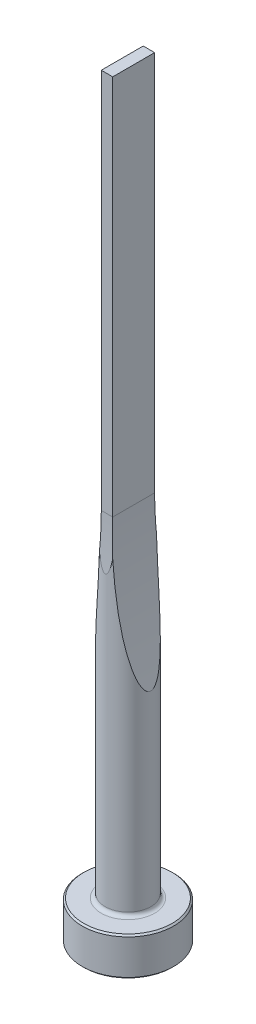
ISO-10303-21;
HEADER;
FILE_DESCRIPTION(('STEP AP214'),'2;1');
FILE_NAME('part.step','',(''),(''),'','','');
FILE_SCHEMA(('AUTOMOTIVE_DESIGN { 1 0 10303 214 1 1 1 1 }'));
ENDSEC;
DATA;
#1=APPLICATION_CONTEXT('core data for automotive mechanical design processes');
#2=APPLICATION_PROTOCOL_DEFINITION('international standard','automotive_design',2000,#1);
#3=PRODUCT_CONTEXT('',#1,'mechanical');
#4=PRODUCT('Part','Part','',(#3));
#5=PRODUCT_RELATED_PRODUCT_CATEGORY('part','',(#4));
#6=PRODUCT_DEFINITION_FORMATION('','',#4);
#7=PRODUCT_DEFINITION_CONTEXT('part definition',#1,'design');
#8=PRODUCT_DEFINITION('design','',#6,#7);
#9=PRODUCT_DEFINITION_SHAPE('','',#8);
#10=(LENGTH_UNIT() NAMED_UNIT(*) SI_UNIT(.MILLI.,.METRE.));
#11=(NAMED_UNIT(*) PLANE_ANGLE_UNIT() SI_UNIT($,.RADIAN.));
#12=(NAMED_UNIT(*) SI_UNIT($,.STERADIAN.) SOLID_ANGLE_UNIT());
#13=UNCERTAINTY_MEASURE_WITH_UNIT(LENGTH_MEASURE(1.E-05),#10,'distance_accuracy_value','');
#14=(GEOMETRIC_REPRESENTATION_CONTEXT(3) GLOBAL_UNCERTAINTY_ASSIGNED_CONTEXT((#13)) GLOBAL_UNIT_ASSIGNED_CONTEXT((#10,
#11,#12)) REPRESENTATION_CONTEXT('',''));
#15=CARTESIAN_POINT('',(0.,0.,0.));
#16=DIRECTION('',(0.,0.,1.));
#17=DIRECTION('',(1.,0.,0.));
#18=AXIS2_PLACEMENT_3D('',#15,#16,#17);
#19=CARTESIAN_POINT('',(0.,0.,0.));
#20=DIRECTION('',(0.,1.,0.));
#21=DIRECTION('',(-1.,0.,0.));
#22=AXIS2_PLACEMENT_3D('',#19,#20,#21);
#23=PLANE('',#22);
#24=CARTESIAN_POINT('',(0.,0.,0.));
#25=DIRECTION('',(0.,1.,0.));
#26=DIRECTION('',(-1.,0.,0.));
#27=AXIS2_PLACEMENT_3D('',#24,#25,#26);
#28=CIRCLE('',#27,5.8);
#29=CARTESIAN_POINT('',(-5.8,0.,0.));
#30=VERTEX_POINT('',#29);
#31=EDGE_CURVE('E133',#30,#30,#28,.T.);
#32=ORIENTED_EDGE('',*,*,#31,.F.);
#33=EDGE_LOOP('',(#32));
#34=FACE_BOUND('',#33,.T.);
#35=ADVANCED_FACE('F32',(#34),#23,.F.);
#36=CARTESIAN_POINT('',(0.,0.,0.));
#37=DIRECTION('',(0.,1.,0.));
#38=DIRECTION('',(-1.,0.,0.));
#39=AXIS2_PLACEMENT_3D('',#36,#37,#38);
#40=CONICAL_SURFACE('',#39,5.8,0.785398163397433);
#41=CARTESIAN_POINT('',(0.,0.200000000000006,0.));
#42=DIRECTION('',(0.,1.,0.));
#43=DIRECTION('',(-1.,0.,0.));
#44=AXIS2_PLACEMENT_3D('',#41,#42,#43);
#45=CIRCLE('',#44,6.);
#46=CARTESIAN_POINT('',(-6.,0.200000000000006,0.));
#47=VERTEX_POINT('',#46);
#48=EDGE_CURVE('E130',#47,#47,#45,.T.);
#49=ORIENTED_EDGE('',*,*,#48,.F.);
#50=EDGE_LOOP('',(#49));
#51=FACE_BOUND('',#50,.T.);
#52=ORIENTED_EDGE('',*,*,#31,.T.);
#53=EDGE_LOOP('',(#52));
#54=FACE_BOUND('',#53,.T.);
#55=ADVANCED_FACE('F171',(#51,#54),#40,.T.);
#56=CARTESIAN_POINT('',(0.,100.,0.));
#57=DIRECTION('',(0.,1.,0.));
#58=DIRECTION('',(-1.,0.,0.));
#59=AXIS2_PLACEMENT_3D('',#56,#57,#58);
#60=CYLINDRICAL_SURFACE('',#59,6.);
#61=CARTESIAN_POINT('',(0.,4.8,0.));
#62=DIRECTION('',(0.,1.,0.));
#63=DIRECTION('',(-1.,0.,0.));
#64=AXIS2_PLACEMENT_3D('',#61,#62,#63);
#65=CIRCLE('',#64,6.);
#66=CARTESIAN_POINT('',(-6.,4.8,0.));
#67=VERTEX_POINT('',#66);
#68=EDGE_CURVE('E127',#67,#67,#65,.T.);
#69=ORIENTED_EDGE('',*,*,#68,.F.);
#70=EDGE_LOOP('',(#69));
#71=FACE_BOUND('',#70,.T.);
#72=ORIENTED_EDGE('',*,*,#48,.T.);
#73=EDGE_LOOP('',(#72));
#74=FACE_BOUND('',#73,.T.);
#75=ADVANCED_FACE('F176',(#71,#74),#60,.T.);
#76=CARTESIAN_POINT('',(0.,4.8,0.));
#77=DIRECTION('',(0.,-1.,0.));
#78=DIRECTION('',(1.,0.,0.));
#79=AXIS2_PLACEMENT_3D('',#76,#77,#78);
#80=CONICAL_SURFACE('',#79,6.,0.785398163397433);
#81=CARTESIAN_POINT('',(0.,5.,0.));
#82=DIRECTION('',(0.,1.,0.));
#83=DIRECTION('',(-1.,0.,0.));
#84=AXIS2_PLACEMENT_3D('',#81,#82,#83);
#85=CIRCLE('',#84,5.8);
#86=CARTESIAN_POINT('',(-5.8,5.,0.));
#87=VERTEX_POINT('',#86);
#88=EDGE_CURVE('E124',#87,#87,#85,.T.);
#89=ORIENTED_EDGE('',*,*,#88,.F.);
#90=EDGE_LOOP('',(#89));
#91=FACE_BOUND('',#90,.T.);
#92=ORIENTED_EDGE('',*,*,#68,.T.);
#93=EDGE_LOOP('',(#92));
#94=FACE_BOUND('',#93,.T.);
#95=ADVANCED_FACE('F183',(#91,#94),#80,.T.);
#96=CARTESIAN_POINT('',(5.8,5.,0.));
#97=DIRECTION('',(0.,-1.,0.));
#98=DIRECTION('',(1.,0.,0.));
#99=AXIS2_PLACEMENT_3D('',#96,#97,#98);
#100=PLANE('',#99);
#101=CARTESIAN_POINT('',(0.,5.,0.));
#102=DIRECTION('',(0.,1.,0.));
#103=DIRECTION('',(-1.,0.,0.));
#104=AXIS2_PLACEMENT_3D('',#101,#102,#103);
#105=CIRCLE('',#104,3.50000000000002);
#106=CARTESIAN_POINT('',(-3.50000000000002,5.,0.));
#107=VERTEX_POINT('',#106);
#108=EDGE_CURVE('E121',#107,#107,#105,.T.);
#109=ORIENTED_EDGE('',*,*,#108,.F.);
#110=EDGE_LOOP('',(#109));
#111=FACE_BOUND('',#110,.T.);
#112=ORIENTED_EDGE('',*,*,#88,.T.);
#113=EDGE_LOOP('',(#112));
#114=FACE_BOUND('',#113,.T.);
#115=ADVANCED_FACE('F190',(#111,#114),#100,.F.);
#116=CARTESIAN_POINT('',(0.,5.5,0.));
#117=DIRECTION('',(0.,1.,0.));
#118=DIRECTION('',(-1.,0.,0.));
#119=AXIS2_PLACEMENT_3D('',#116,#117,#118);
#120=TOROIDAL_SURFACE('',#119,3.50000000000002,0.5);
#121=CARTESIAN_POINT('',(0.,5.50000000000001,0.));
#122=DIRECTION('',(0.,1.,0.));
#123=DIRECTION('',(-1.,0.,0.));
#124=AXIS2_PLACEMENT_3D('',#121,#122,#123);
#125=CIRCLE('',#124,3.00000000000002);
#126=CARTESIAN_POINT('',(-3.00000000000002,5.50000000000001,0.));
#127=VERTEX_POINT('',#126);
#128=EDGE_CURVE('E112',#127,#127,#125,.T.);
#129=ORIENTED_EDGE('',*,*,#128,.F.);
#130=EDGE_LOOP('',(#129));
#131=FACE_BOUND('',#130,.T.);
#132=ORIENTED_EDGE('',*,*,#108,.T.);
#133=EDGE_LOOP('',(#132));
#134=FACE_BOUND('',#133,.T.);
#135=ADVANCED_FACE('F168',(#131,#134),#120,.F.);
#136=CARTESIAN_POINT('',(0.,100.,0.));
#137=DIRECTION('',(0.,1.,0.));
#138=DIRECTION('',(-1.,0.,0.));
#139=AXIS2_PLACEMENT_3D('',#136,#137,#138);
#140=CYLINDRICAL_SURFACE('',#139,3.00000000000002);
#141=CARTESIAN_POINT('',(3.00000000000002,30.0015625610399,0.));
#142=CARTESIAN_POINT('',(2.99999836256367,30.001569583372,0.0473423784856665));
#143=CARTESIAN_POINT('',(2.99886099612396,30.0065583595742,0.0947066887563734));
#144=CARTESIAN_POINT('',(2.99450019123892,30.025707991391,0.187466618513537));
#145=CARTESIAN_POINT('',(2.99127162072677,30.0398914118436,0.232857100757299));
#146=CARTESIAN_POINT('',(2.98232364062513,30.0792704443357,0.32949939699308));
#147=CARTESIAN_POINT('',(2.97622667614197,30.1061391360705,0.380016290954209));
#148=CARTESIAN_POINT('',(2.9623898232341,30.167287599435,0.476041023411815));
#149=CARTESIAN_POINT('',(2.95464669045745,30.2015820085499,0.521538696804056));
#150=CARTESIAN_POINT('',(2.9389076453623,30.2715125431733,0.603644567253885));
#151=CARTESIAN_POINT('',(2.93101405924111,30.3066732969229,0.640686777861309));
#152=CARTESIAN_POINT('',(2.914611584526,30.3799604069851,0.711593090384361));
#153=CARTESIAN_POINT('',(2.90610216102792,30.4180893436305,0.745454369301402));
#154=CARTESIAN_POINT('',(2.8886378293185,30.496598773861,0.810498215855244));
#155=CARTESIAN_POINT('',(2.87968195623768,30.5369841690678,0.841674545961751));
#156=CARTESIAN_POINT('',(2.86147114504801,30.6193839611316,0.901644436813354));
#157=CARTESIAN_POINT('',(2.85221632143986,30.6613977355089,0.930438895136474));
#158=CARTESIAN_POINT('',(2.82800781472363,30.7716855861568,1.00226756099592));
#159=CARTESIAN_POINT('',(2.81289165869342,30.840925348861,1.04376218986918));
#160=CARTESIAN_POINT('',(2.78234782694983,30.9816568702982,1.12263922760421));
#161=CARTESIAN_POINT('',(2.76691998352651,31.0531498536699,1.16001934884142));
#162=CARTESIAN_POINT('',(2.720341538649,31.27031451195,1.26722877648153));
#163=CARTESIAN_POINT('',(2.68894801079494,31.4184354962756,1.33198185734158));
#164=CARTESIAN_POINT('',(2.62600993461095,31.7192401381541,1.45211974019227));
#165=CARTESIAN_POINT('',(2.59446548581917,31.8719441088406,1.50745208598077));
#166=CARTESIAN_POINT('',(2.54740994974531,32.1028137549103,1.58480396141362));
#167=CARTESIAN_POINT('',(2.53177721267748,32.1800276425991,1.60963414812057));
#168=CARTESIAN_POINT('',(2.5006166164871,32.3349900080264,1.6576295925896));
#169=CARTESIAN_POINT('',(2.48508875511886,32.4127384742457,1.68079488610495));
#170=CARTESIAN_POINT('',(2.43711328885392,32.6546273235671,1.75036211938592));
#171=CARTESIAN_POINT('',(2.40488001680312,32.8195398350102,1.79423432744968));
#172=CARTESIAN_POINT('',(2.34109938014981,33.1508230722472,1.876689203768));
#173=CARTESIAN_POINT('',(2.30955212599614,33.3171940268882,1.91527102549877));
#174=CARTESIAN_POINT('',(2.2472143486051,33.651122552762,1.98804542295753));
#175=CARTESIAN_POINT('',(2.21642422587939,33.8186806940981,2.02223571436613));
#176=CARTESIAN_POINT('',(2.15567345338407,34.1546707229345,2.0868714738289));
#177=CARTESIAN_POINT('',(2.12571284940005,34.3231026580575,2.11731673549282));
#178=CARTESIAN_POINT('',(2.03699871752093,34.8302488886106,2.2039780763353));
#179=CARTESIAN_POINT('',(1.97956047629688,35.170023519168,2.25535325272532));
#180=CARTESIAN_POINT('',(1.86841638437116,35.8513865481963,2.34824035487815));
#181=CARTESIAN_POINT('',(1.81470948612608,36.1929744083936,2.38975505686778));
#182=CARTESIAN_POINT('',(1.7110811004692,36.8778446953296,2.46501586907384));
#183=CARTESIAN_POINT('',(1.66116260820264,37.2211282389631,2.49875587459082));
#184=CARTESIAN_POINT('',(1.56522698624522,37.908812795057,2.55994061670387));
#185=CARTESIAN_POINT('',(1.51921010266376,38.2532138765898,2.58738495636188));
#186=CARTESIAN_POINT('',(1.43118603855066,38.9424233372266,2.63709230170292));
#187=CARTESIAN_POINT('',(1.38917354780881,39.2872305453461,2.65936222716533));
#188=CARTESIAN_POINT('',(1.30911922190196,39.9775460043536,2.69966904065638));
#189=CARTESIAN_POINT('',(1.27107735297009,40.3230542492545,2.71770596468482));
#190=CARTESIAN_POINT('',(1.19774812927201,41.0265116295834,2.75083155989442));
#191=CARTESIAN_POINT('',(1.16260001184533,41.3844809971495,2.76579788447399));
#192=CARTESIAN_POINT('',(1.09658867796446,42.1009326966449,2.79262513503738));
#193=CARTESIAN_POINT('',(1.06572553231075,42.4594150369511,2.80448600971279));
#194=CARTESIAN_POINT('',(0.979578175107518,43.5355342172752,2.83623354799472));
#195=CARTESIAN_POINT('',(0.930739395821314,44.2538110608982,2.85228371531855));
#196=CARTESIAN_POINT('',(0.85027655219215,45.6919971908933,2.87728713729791));
#197=CARTESIAN_POINT('',(0.818666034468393,46.4119073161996,2.88623480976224));
#198=CARTESIAN_POINT('',(0.772744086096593,47.8523026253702,2.89886794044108));
#199=CARTESIAN_POINT('',(0.758432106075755,48.5727877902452,2.90255356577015));
#200=CARTESIAN_POINT('',(0.747117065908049,50.0138222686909,2.9054858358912));
#201=CARTESIAN_POINT('',(0.750112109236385,50.7343715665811,2.90473296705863));
#202=CARTESIAN_POINT('',(0.77340486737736,52.1751917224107,2.89861916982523));
#203=CARTESIAN_POINT('',(0.793703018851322,52.8954625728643,2.89325812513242));
#204=CARTESIAN_POINT('',(0.851570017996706,54.3348340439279,2.87675718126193));
#205=CARTESIAN_POINT('',(0.889129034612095,55.0539350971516,2.86562057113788));
#206=CARTESIAN_POINT('',(0.981479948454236,56.4908422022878,2.83532865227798));
#207=CARTESIAN_POINT('',(1.03627082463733,57.2086483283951,2.81617381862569));
#208=CARTESIAN_POINT('',(1.13129125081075,58.2834921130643,2.77872473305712));
#209=CARTESIAN_POINT('',(1.16508115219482,58.6412618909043,2.76479917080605));
#210=CARTESIAN_POINT('',(1.23692678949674,59.3562168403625,2.73341488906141));
#211=CARTESIAN_POINT('',(1.27498246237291,59.713402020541,2.71595622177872));
#212=CARTESIAN_POINT('',(1.35536301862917,60.4272705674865,2.67675020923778));
#213=CARTESIAN_POINT('',(1.3976903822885,60.7839535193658,2.65500036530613));
#214=CARTESIAN_POINT('',(1.48656459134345,61.4964331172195,2.60628020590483));
#215=CARTESIAN_POINT('',(1.53311134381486,61.8522297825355,2.57931000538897));
#216=CARTESIAN_POINT('',(1.63023170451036,62.5616348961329,2.51904862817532));
#217=CARTESIAN_POINT('',(1.68079262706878,62.9152467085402,2.4857769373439));
#218=CARTESIAN_POINT('',(1.78598929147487,63.621016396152,2.41130618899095));
#219=CARTESIAN_POINT('',(1.84062481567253,63.9731743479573,2.3701075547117));
#220=CARTESIAN_POINT('',(1.953807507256,64.6752325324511,2.27771809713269));
#221=CARTESIAN_POINT('',(2.01235086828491,65.025134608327,2.22653690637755));
#222=CARTESIAN_POINT('',(2.10296737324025,65.5478259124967,2.13991936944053));
#223=CARTESIAN_POINT('',(2.13363642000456,65.7216779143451,2.10940961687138));
#224=CARTESIAN_POINT('',(2.19586793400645,66.0685009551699,2.04455139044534));
#225=CARTESIAN_POINT('',(2.2274303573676,66.2414720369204,2.01020310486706));
#226=CARTESIAN_POINT('',(2.29142610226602,66.5864860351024,1.93693969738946));
#227=CARTESIAN_POINT('',(2.32386030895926,66.7585277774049,1.89801978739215));
#228=CARTESIAN_POINT('',(2.38949093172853,67.1011949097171,1.81470429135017));
#229=CARTESIAN_POINT('',(2.42268753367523,67.2718199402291,1.77030735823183));
#230=CARTESIAN_POINT('',(2.48973104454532,67.6112144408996,1.67470987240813));
#231=CARTESIAN_POINT('',(2.52357852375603,67.779982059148,1.62350309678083));
#232=CARTESIAN_POINT('',(2.5916647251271,68.1145521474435,1.51246349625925));
#233=CARTESIAN_POINT('',(2.62590323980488,68.2803560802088,1.45263506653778));
#234=CARTESIAN_POINT('',(2.67732280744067,68.5259438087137,1.35399732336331));
#235=CARTESIAN_POINT('',(2.69451343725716,68.6074746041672,1.31954403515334));
#236=CARTESIAN_POINT('',(2.72879452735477,68.7689688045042,1.24711346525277));
#237=CARTESIAN_POINT('',(2.74588501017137,68.8489325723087,1.20913701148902));
#238=CARTESIAN_POINT('',(2.7797794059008,69.0064926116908,1.12903166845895));
#239=CARTESIAN_POINT('',(2.79658407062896,69.0840957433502,1.08691670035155));
#240=CARTESIAN_POINT('',(2.82974187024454,69.2362744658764,0.997419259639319));
#241=CARTESIAN_POINT('',(2.8460953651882,69.3108524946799,0.950041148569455));
#242=CARTESIAN_POINT('',(2.87389048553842,69.4368827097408,0.86157476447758));
#243=CARTESIAN_POINT('',(2.88551383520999,69.4893502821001,0.822001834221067));
#244=CARTESIAN_POINT('',(2.90808341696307,69.5908241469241,0.738200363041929));
#245=CARTESIAN_POINT('',(2.91902833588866,69.6398237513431,0.693963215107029));
#246=CARTESIAN_POINT('',(2.93992157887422,69.7330288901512,0.599368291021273));
#247=CARTESIAN_POINT('',(2.94985727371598,69.7771741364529,0.548947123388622));
#248=CARTESIAN_POINT('',(2.96784697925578,69.8568695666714,0.441394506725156));
#249=CARTESIAN_POINT('',(2.9759079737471,69.8924516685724,0.384289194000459));
#250=CARTESIAN_POINT('',(2.98643830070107,69.9388457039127,0.287285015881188));
#251=CARTESIAN_POINT('',(2.9898577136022,69.9538862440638,0.249531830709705));
#252=CARTESIAN_POINT('',(2.99531399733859,69.977868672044,0.172036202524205));
#253=CARTESIAN_POINT('',(2.99735266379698,69.9868184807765,0.132296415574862));
#254=CARTESIAN_POINT('',(2.99983082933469,69.9976959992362,0.0515246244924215));
#255=CARTESIAN_POINT('',(3.00025982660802,69.9995775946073,0.0104858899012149));
#256=CARTESIAN_POINT('',(2.9994324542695,69.9959470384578,-0.0712521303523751));
#257=CARTESIAN_POINT('',(2.99817545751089,69.9904321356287,-0.111951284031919));
#258=CARTESIAN_POINT('',(2.99428038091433,69.9733257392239,-0.188848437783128));
#259=CARTESIAN_POINT('',(2.99174839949,69.962200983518,-0.225159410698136));
#260=CARTESIAN_POINT('',(2.98559180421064,69.9351159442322,-0.295805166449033));
#261=CARTESIAN_POINT('',(2.9819667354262,69.9191536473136,-0.330139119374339));
#262=CARTESIAN_POINT('',(2.97084250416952,69.870090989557,-0.421317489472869));
#263=CARTESIAN_POINT('',(2.96246619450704,69.8330694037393,-0.475931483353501));
#264=CARTESIAN_POINT('',(2.94407875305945,69.7515051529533,-0.57892722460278));
#265=CARTESIAN_POINT('',(2.93406179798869,69.7069356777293,-0.627285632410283));
#266=CARTESIAN_POINT('',(2.91297275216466,69.6127251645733,-0.718889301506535));
#267=CARTESIAN_POINT('',(2.90189612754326,69.5630622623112,-0.762110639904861));
#268=CARTESIAN_POINT('',(2.87908868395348,69.4603627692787,-0.844194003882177));
#269=CARTESIAN_POINT('',(2.86735717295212,69.4073226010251,-0.883051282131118));
#270=CARTESIAN_POINT('',(2.84345512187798,69.2987684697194,-0.957226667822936));
#271=CARTESIAN_POINT('',(2.83128369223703,69.2432494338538,-0.992536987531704));
#272=CARTESIAN_POINT('',(2.80668083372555,69.1304978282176,-1.06010911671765));
#273=CARTESIAN_POINT('',(2.79424953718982,69.073266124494,-1.09237243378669));
#274=CARTESIAN_POINT('',(2.75963364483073,68.9131264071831,-1.17810136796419));
#275=CARTESIAN_POINT('',(2.73727331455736,68.808816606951,-1.22887374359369));
#276=CARTESIAN_POINT('',(2.69237221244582,68.597469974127,-1.32434959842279));
#277=CARTESIAN_POINT('',(2.66983133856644,68.4904315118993,-1.36904934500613));
#278=CARTESIAN_POINT('',(2.62472400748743,68.2742427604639,-1.45365922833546));
#279=CARTESIAN_POINT('',(2.60215758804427,68.165088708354,-1.49355970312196));
#280=CARTESIAN_POINT('',(2.55716336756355,67.945365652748,-1.56934860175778));
#281=CARTESIAN_POINT('',(2.53473558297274,67.8347964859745,-1.6052365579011));
#282=CARTESIAN_POINT('',(2.48998847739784,67.612022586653,-1.67381027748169));
#283=CARTESIAN_POINT('',(2.46767026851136,67.4998124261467,-1.70647903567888));
#284=CARTESIAN_POINT('',(2.42331183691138,67.2745286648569,-1.7689049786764));
#285=CARTESIAN_POINT('',(2.40127162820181,67.1614550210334,-1.79866201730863));
#286=CARTESIAN_POINT('',(2.3575408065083,66.9347708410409,-1.85561003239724));
#287=CARTESIAN_POINT('',(2.33584975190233,66.8211612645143,-1.8828045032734));
#288=CARTESIAN_POINT('',(2.29281630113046,66.5933749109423,-1.93497634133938));
#289=CARTESIAN_POINT('',(2.27147389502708,66.4791981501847,-1.95995377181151));
#290=CARTESIAN_POINT('',(2.20118916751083,66.0991013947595,-2.03968419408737));
#291=CARTESIAN_POINT('',(2.15306040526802,65.8321262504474,-2.09014673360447));
#292=CARTESIAN_POINT('',(2.05898880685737,65.2963575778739,-2.18286642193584));
#293=CARTESIAN_POINT('',(2.01304634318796,65.0275637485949,-2.22512217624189));
#294=CARTESIAN_POINT('',(1.9234381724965,64.4884991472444,-2.30302199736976));
#295=CARTESIAN_POINT('',(1.87977369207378,64.2182276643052,-2.33866252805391));
#296=CARTESIAN_POINT('',(1.79481677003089,63.6766414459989,-2.40447830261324));
#297=CARTESIAN_POINT('',(1.75352445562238,63.4053266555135,-2.43465325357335));
#298=CARTESIAN_POINT('',(1.67326326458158,62.8612123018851,-2.49049912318));
#299=CARTESIAN_POINT('',(1.63430029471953,62.5884107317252,-2.51615888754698));
#300=CARTESIAN_POINT('',(1.55883891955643,62.042127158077,-2.56359129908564));
#301=CARTESIAN_POINT('',(1.52234057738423,61.7686451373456,-2.5853638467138));
#302=CARTESIAN_POINT('',(1.41660239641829,60.9475374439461,-2.64572604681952));
#303=CARTESIAN_POINT('',(1.35109180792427,60.3990631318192,-2.67937857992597));
#304=CARTESIAN_POINT('',(1.23014264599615,59.3005646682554,-2.73700662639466));
#305=CARTESIAN_POINT('',(1.17470340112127,58.7505406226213,-2.76098278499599));
#306=CARTESIAN_POINT('',(1.07394686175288,57.6492647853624,-2.80171188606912));
#307=CARTESIAN_POINT('',(1.02863029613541,57.0980129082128,-2.81846430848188));
#308=CARTESIAN_POINT('',(0.948211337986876,55.995329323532,-2.84652440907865));
#309=CARTESIAN_POINT('',(0.913096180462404,55.4438987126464,-2.8578389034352));
#310=CARTESIAN_POINT('',(0.853025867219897,54.3404314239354,-2.87634045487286));
#311=CARTESIAN_POINT('',(0.82807043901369,53.7883947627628,-2.88352762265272));
#312=CARTESIAN_POINT('',(0.790826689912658,52.7532904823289,-2.89394418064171));
#313=CARTESIAN_POINT('',(0.777341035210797,52.2702692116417,-2.89755729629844));
#314=CARTESIAN_POINT('',(0.758150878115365,51.3040599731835,-2.90263792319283));
#315=CARTESIAN_POINT('',(0.752446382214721,50.8208720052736,-2.90410543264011));
#316=CARTESIAN_POINT('',(0.748819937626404,49.8543120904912,-2.90504247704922));
#317=CARTESIAN_POINT('',(0.750900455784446,49.3709401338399,-2.90451137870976));
#318=CARTESIAN_POINT('',(0.762848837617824,48.4042999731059,-2.90139622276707));
#319=CARTESIAN_POINT('',(0.772716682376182,47.921031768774,-2.89881217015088));
#320=CARTESIAN_POINT('',(0.80021586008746,46.9554541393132,-2.89134181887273));
#321=CARTESIAN_POINT('',(0.817835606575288,46.4731443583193,-2.88645895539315));
#322=CARTESIAN_POINT('',(0.860829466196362,45.5089067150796,-2.87393023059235));
#323=CARTESIAN_POINT('',(0.886203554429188,45.0269788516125,-2.86628437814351));
#324=CARTESIAN_POINT('',(0.944690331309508,44.0637449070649,-2.84754337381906));
#325=CARTESIAN_POINT('',(0.97780164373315,43.5824387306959,-2.83644883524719));
#326=CARTESIAN_POINT('',(1.05174813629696,42.6205508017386,-2.80987100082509));
#327=CARTESIAN_POINT('',(1.09258307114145,42.1399690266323,-2.79438784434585));
#328=CARTESIAN_POINT('',(1.16763484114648,41.3335559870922,-2.76363881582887));
#329=CARTESIAN_POINT('',(1.19978073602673,41.0074728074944,-2.74989248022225));
#330=CARTESIAN_POINT('',(1.267615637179,40.3558204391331,-2.71928982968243));
#331=CARTESIAN_POINT('',(1.30330462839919,40.0302512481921,-2.70243352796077));
#332=CARTESIAN_POINT('',(1.37821127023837,39.3797088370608,-2.66501209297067));
#333=CARTESIAN_POINT('',(1.4174291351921,39.0547356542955,-2.64444673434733));
#334=CARTESIAN_POINT('',(1.49936533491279,38.4055504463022,-2.5988642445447));
#335=CARTESIAN_POINT('',(1.54208360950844,38.0813384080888,-2.57384718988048));
#336=CARTESIAN_POINT('',(1.64706895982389,37.3167180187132,-2.50844439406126));
#337=CARTESIAN_POINT('',(1.71081800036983,36.8766985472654,-2.46577273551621));
#338=CARTESIAN_POINT('',(1.81114447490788,36.2185179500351,-2.39195743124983));
#339=CARTESIAN_POINT('',(1.84536869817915,35.9994429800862,-2.36571918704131));
#340=CARTESIAN_POINT('',(1.91535504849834,35.5620324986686,-2.30942326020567));
#341=CARTESIAN_POINT('',(1.95111713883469,35.3436969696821,-2.27936566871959));
#342=CARTESIAN_POINT('',(2.03772125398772,34.8268838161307,-2.20276602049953));
#343=CARTESIAN_POINT('',(2.08922450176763,34.5288047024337,-2.15425103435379));
#344=CARTESIAN_POINT('',(2.1948995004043,33.9349733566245,-2.04649670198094));
#345=CARTESIAN_POINT('',(2.24907161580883,33.6392214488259,-1.98725588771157));
#346=CARTESIAN_POINT('',(2.34275139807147,33.1417277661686,-1.87485358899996));
#347=CARTESIAN_POINT('',(2.38164833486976,32.9390323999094,-1.82542061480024));
#348=CARTESIAN_POINT('',(2.46036496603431,32.5362556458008,-1.71786982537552));
#349=CARTESIAN_POINT('',(2.50018394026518,32.3361723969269,-1.65975860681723));
#350=CARTESIAN_POINT('',(2.56840598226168,31.9992626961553,-1.55114846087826));
#351=CARTESIAN_POINT('',(2.59665176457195,31.8614591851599,-1.50359225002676));
#352=CARTESIAN_POINT('',(2.65330912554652,31.5882506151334,-1.40121596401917));
#353=CARTESIAN_POINT('',(2.68172091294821,31.4528504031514,-1.34638276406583));
#354=CARTESIAN_POINT('',(2.72522394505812,31.2478216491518,-1.25475118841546));
#355=CARTESIAN_POINT('',(2.74040510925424,31.1767062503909,-1.22132415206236));
#356=CARTESIAN_POINT('',(2.77059912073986,31.0360820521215,-1.15119189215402));
#357=CARTESIAN_POINT('',(2.78561201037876,30.9665728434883,-1.11448751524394));
#358=CARTESIAN_POINT('',(2.81529234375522,30.8299174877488,-1.03722585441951));
#359=CARTESIAN_POINT('',(2.82996068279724,30.7627649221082,-0.996680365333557));
#360=CARTESIAN_POINT('',(2.85877490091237,30.6315450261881,-0.910749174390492));
#361=CARTESIAN_POINT('',(2.87292124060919,30.5674749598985,-0.865367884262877));
#362=CARTESIAN_POINT('',(2.89751966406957,30.4566064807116,-0.778444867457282));
#363=CARTESIAN_POINT('',(2.90813307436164,30.4089663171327,-0.738033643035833));
#364=CARTESIAN_POINT('',(2.9285306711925,30.3177310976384,-0.652418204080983));
#365=CARTESIAN_POINT('',(2.93831311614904,30.2741445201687,-0.607204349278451));
#366=CARTESIAN_POINT('',(2.95667488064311,30.1925813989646,-0.510434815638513));
#367=CARTESIAN_POINT('',(2.96523409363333,30.1546981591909,-0.458794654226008));
#368=CARTESIAN_POINT('',(2.98011403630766,30.0889915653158,-0.349188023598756));
#369=CARTESIAN_POINT('',(2.98644565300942,30.0611192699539,-0.291254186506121));
#370=CARTESIAN_POINT('',(2.99397502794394,30.0280133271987,-0.193639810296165));
#371=CARTESIAN_POINT('',(2.99621159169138,30.0181916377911,-0.15560533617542));
#372=CARTESIAN_POINT('',(2.99922405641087,30.0049664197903,-0.0783848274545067));
#373=CARTESIAN_POINT('',(3.00000135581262,30.0015567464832,-0.039199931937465));
#374=CARTESIAN_POINT('',(3.00000000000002,30.0015625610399,0.));
#375=B_SPLINE_CURVE_WITH_KNOTS('',3,(#141,#142,#143,#144,#145,#146,#147,#148,#149,#150,#151,
#152,#153,#154,#155,#156,#157,#158,#159,#160,#161,#162,#163,#164,#165,#166,#167,#168,#169,#170,
#171,#172,#173,#174,#175,#176,#177,#178,#179,#180,#181,#182,#183,#184,#185,#186,#187,#188,#189,
#190,#191,#192,#193,#194,#195,#196,#197,#198,#199,#200,#201,#202,#203,#204,#205,#206,#207,#208,
#209,#210,#211,#212,#213,#214,#215,#216,#217,#218,#219,#220,#221,#222,#223,#224,#225,#226,#227,
#228,#229,#230,#231,#232,#233,#234,#235,#236,#237,#238,#239,#240,#241,#242,#243,#244,#245,#246,
#247,#248,#249,#250,#251,#252,#253,#254,#255,#256,#257,#258,#259,#260,#261,#262,#263,#264,#265,
#266,#267,#268,#269,#270,#271,#272,#273,#274,#275,#276,#277,#278,#279,#280,#281,#282,#283,#284,
#285,#286,#287,#288,#289,#290,#291,#292,#293,#294,#295,#296,#297,#298,#299,#300,#301,#302,#303,
#304,#305,#306,#307,#308,#309,#310,#311,#312,#313,#314,#315,#316,#317,#318,#319,#320,#321,#322,
#323,#324,#325,#326,#327,#328,#329,#330,#331,#332,#333,#334,#335,#336,#337,#338,#339,#340,#341,
#342,#343,#344,#345,#346,#347,#348,#349,#350,#351,#352,#353,#354,#355,#356,#357,#358,#359,#360,
#361,#362,#363,#364,#365,#366,#367,#368,#369,#370,#371,#372,#373,#374),.UNSPECIFIED.,.T.,.F.,(4,
2,2,2,2,2,2,2,2,2,2,2,2,2,2,2,2,2,2,2,2,2,2,2,2,2,2,2,2,2,2,2,2,2,2,2,2,2,2,2,2,2,2,2,2,2,2,2,2,
2,2,2,2,2,2,2,2,2,2,2,2,2,2,2,2,2,2,2,2,2,2,2,2,2,2,2,2,2,2,2,2,2,2,2,2,2,2,2,2,2,2,2,2,2,2,2,2,
2,2,2,2,2,2,2,2,2,2,2,2,2,2,2,2,2,2,2,4),(0.,0.141817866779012,0.283985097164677,
0.455616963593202,0.627590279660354,0.782402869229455,0.93735157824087,1.09265105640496,
1.24789174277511,1.49407298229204,1.74039041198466,2.23386853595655,2.73001042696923,
2.97779642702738,3.22557710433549,3.7464520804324,4.26741030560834,4.78863842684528,
5.30989526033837,6.35486948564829,7.3995491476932,8.44504631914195,9.49060939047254,
10.5347660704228,11.5789138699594,12.6588762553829,13.7388564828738,15.8989139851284,
18.060667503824,20.222352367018,22.3838003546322,24.5453028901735,26.7055758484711,
28.8657208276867,29.9445811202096,31.0234254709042,32.1028998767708,33.1823505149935,
34.2585161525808,35.3346243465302,36.4096992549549,36.9471239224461,37.4845222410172,
38.0224885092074,38.5605873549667,39.099181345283,39.6375017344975,39.9079361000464,
40.1783070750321,40.4477978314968,40.7170669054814,40.9170957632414,41.1175004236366,
41.320164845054,41.5220617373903,41.6439757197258,41.7657308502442,41.8882789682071,
42.0108726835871,42.1246283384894,42.2384314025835,42.436796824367,42.6358822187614,
42.8358611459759,43.036055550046,43.2366803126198,43.4372052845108,43.7913573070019,
44.1457260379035,44.5007966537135,44.8559086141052,45.212805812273,45.5697209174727,
45.9261420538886,46.2825530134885,47.1101499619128,47.9378874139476,48.7660660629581,
49.5942890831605,50.4245302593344,51.2547926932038,52.9147480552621,54.5745927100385,
56.2345568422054,57.8924348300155,59.5502683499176,60.9998712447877,62.4494753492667,
63.8995388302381,65.3495987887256,66.7974987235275,68.2453940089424,69.693031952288,
71.140623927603,72.1244502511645,73.1082723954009,74.0921543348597,75.07601936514,
76.4157602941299,77.0855665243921,77.755356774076,78.674286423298,79.5933419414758,
80.2298994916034,80.8659756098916,81.311313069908,81.7574649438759,81.9974999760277,
82.2374731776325,82.4767320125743,82.7157744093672,82.9056440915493,83.0959023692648,
83.2889965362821,83.4811334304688,83.5986726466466,83.7160991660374),.UNSPECIFIED.);
#376=CARTESIAN_POINT('',(0.870828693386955,45.3379655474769,-2.87082869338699));
#377=VERTEX_POINT('',#376);
#378=CARTESIAN_POINT('',(0.870828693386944,45.3379655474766,2.870828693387));
#379=VERTEX_POINT('',#378);
#380=EDGE_CURVE('E138',#377,#379,#375,.T.);
#381=ORIENTED_EDGE('',*,*,#380,.T.);
#382=CARTESIAN_POINT('',(-1.19895788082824,50.,2.74999999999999));
#383=CARTESIAN_POINT('',(-1.19897952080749,50.5078240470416,2.75000052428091));
#384=CARTESIAN_POINT('',(-1.18927252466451,51.0156821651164,2.75430147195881));
#385=CARTESIAN_POINT('',(-1.15875125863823,51.7777588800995,2.76719867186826));
#386=CARTESIAN_POINT('',(-1.14587302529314,52.0323726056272,2.77259034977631));
#387=CARTESIAN_POINT('',(-1.11408427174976,52.5410752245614,2.78552021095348));
#388=CARTESIAN_POINT('',(-1.09517627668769,52.7951642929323,2.79305749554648));
#389=CARTESIAN_POINT('',(-1.05054489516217,53.2992875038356,2.81014523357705));
#390=CARTESIAN_POINT('',(-1.02491501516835,53.5493308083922,2.81966772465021));
#391=CARTESIAN_POINT('',(-0.964932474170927,54.0487156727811,2.84076574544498));
#392=CARTESIAN_POINT('',(-0.930566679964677,54.2980555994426,2.85234435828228));
#393=CARTESIAN_POINT('',(-0.870049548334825,54.6696537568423,2.87113933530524));
#394=CARTESIAN_POINT('',(-0.848472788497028,54.7926943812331,2.87761721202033));
#395=CARTESIAN_POINT('',(-0.801568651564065,55.0380271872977,2.89103629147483));
#396=CARTESIAN_POINT('',(-0.776241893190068,55.1603194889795,2.89797741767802));
#397=CARTESIAN_POINT('',(-0.720753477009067,55.4034742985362,2.91227256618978));
#398=CARTESIAN_POINT('',(-0.690603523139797,55.5243395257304,2.91962556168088));
#399=CARTESIAN_POINT('',(-0.623527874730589,55.7641294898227,2.93469409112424));
#400=CARTESIAN_POINT('',(-0.586609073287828,55.8830560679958,2.94240925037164));
#401=CARTESIAN_POINT('',(-0.532225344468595,56.0331253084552,2.95243594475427));
#402=CARTESIAN_POINT('',(-0.519782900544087,56.0660915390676,2.95465705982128));
#403=CARTESIAN_POINT('',(-0.493824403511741,56.1316010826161,2.95910656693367));
#404=CARTESIAN_POINT('',(-0.480308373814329,56.164144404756,2.96133495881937));
#405=CARTESIAN_POINT('',(-0.437923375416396,56.2607815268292,2.96800415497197));
#406=CARTESIAN_POINT('',(-0.407160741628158,56.324045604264,2.9724398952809));
#407=CARTESIAN_POINT('',(-0.339480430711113,56.443295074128,2.9809226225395));
#408=CARTESIAN_POINT('',(-0.302974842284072,56.4994884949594,2.98497775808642));
#409=CARTESIAN_POINT('',(-0.24324965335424,56.5706099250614,2.99016761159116));
#410=CARTESIAN_POINT('',(-0.225380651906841,56.5899122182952,2.99158318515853));
#411=CARTESIAN_POINT('',(-0.187063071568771,56.6257850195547,2.99422420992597));
#412=CARTESIAN_POINT('',(-0.166623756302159,56.6423648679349,2.99545031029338));
#413=CARTESIAN_POINT('',(-0.132225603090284,56.6647469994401,2.99711026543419));
#414=CARTESIAN_POINT('',(-0.119296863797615,56.6721061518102,2.99765718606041));
#415=CARTESIAN_POINT('',(-0.0924786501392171,56.684833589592,2.99860424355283));
#416=CARTESIAN_POINT('',(-0.0785901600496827,56.6902038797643,2.99900452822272));
#417=CARTESIAN_POINT('',(-0.0498799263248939,56.6984547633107,2.99961993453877));
#418=CARTESIAN_POINT('',(-0.0350488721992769,56.7013042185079,2.99983274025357));
#419=CARTESIAN_POINT('',(-0.00511706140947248,56.7039833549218,3.00003281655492));
#420=CARTESIAN_POINT('',(0.0099834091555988,56.7038160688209,3.00002031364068));
#421=CARTESIAN_POINT('',(0.037747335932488,56.7007339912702,2.99979016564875));
#422=CARTESIAN_POINT('',(0.0504568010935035,56.6982058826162,2.99960139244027));
#423=CARTESIAN_POINT('',(0.0753269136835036,56.6912160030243,2.99908000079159));
#424=CARTESIAN_POINT('',(0.0874870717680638,56.6867525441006,2.99874725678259));
#425=CARTESIAN_POINT('',(0.11730456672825,56.6734908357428,2.99776000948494));
#426=CARTESIAN_POINT('',(0.134490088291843,56.6636473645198,2.99702831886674));
#427=CARTESIAN_POINT('',(0.16715399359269,56.6414692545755,2.99538445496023));
#428=CARTESIAN_POINT('',(0.182627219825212,56.6291273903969,2.99447175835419));
#429=CARTESIAN_POINT('',(0.225718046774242,56.5906116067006,2.99163284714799));
#430=CARTESIAN_POINT('',(0.251307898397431,56.5622150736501,2.98955095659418));
#431=CARTESIAN_POINT('',(0.298583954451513,56.5023955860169,2.98519748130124));
#432=CARTESIAN_POINT('',(0.320256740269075,56.4709627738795,2.98292528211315));
#433=CARTESIAN_POINT('',(0.376076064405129,56.3821026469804,2.97655204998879));
#434=CARTESIAN_POINT('',(0.407351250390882,56.3228981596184,2.97236032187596));
#435=CARTESIAN_POINT('',(0.46471545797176,56.2019914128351,2.9639263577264));
#436=CARTESIAN_POINT('',(0.490790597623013,56.1402829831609,2.95968401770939));
#437=CARTESIAN_POINT('',(0.539393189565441,56.0151533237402,2.95121450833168));
#438=CARTESIAN_POINT('',(0.561903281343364,55.951725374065,2.94698750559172));
#439=CARTESIAN_POINT('',(0.604138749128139,55.824059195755,2.93861747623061));
#440=CARTESIAN_POINT('',(0.623867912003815,55.7598222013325,2.93447434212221));
#441=CARTESIAN_POINT('',(0.687009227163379,55.5416029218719,2.92063784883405));
#442=CARTESIAN_POINT('',(0.725502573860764,55.3861879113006,2.91118093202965));
#443=CARTESIAN_POINT('',(0.794909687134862,55.0736090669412,2.89298537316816));
#444=CARTESIAN_POINT('',(0.825818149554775,54.9164440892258,2.88424723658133));
#445=CARTESIAN_POINT('',(0.88213044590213,54.6006711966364,2.86752741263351));
#446=CARTESIAN_POINT('',(0.907519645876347,54.4420605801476,2.85954776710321));
#447=CARTESIAN_POINT('',(0.953912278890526,54.124222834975,2.84440447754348));
#448=CARTESIAN_POINT('',(0.974917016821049,53.9649959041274,2.83724059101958));
#449=CARTESIAN_POINT('',(1.03276252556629,53.4851511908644,2.81693320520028));
#450=CARTESIAN_POINT('',(1.06419241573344,53.1638255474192,2.80505126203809));
#451=CARTESIAN_POINT('',(1.11623470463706,52.5208794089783,2.78473743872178));
#452=CARTESIAN_POINT('',(1.13686835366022,52.1992607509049,2.77629878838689));
#453=CARTESIAN_POINT('',(1.16917424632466,51.5546671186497,2.76284984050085));
#454=CARTESIAN_POINT('',(1.18082300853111,51.2316907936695,2.75784852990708));
#455=CARTESIAN_POINT('',(1.19594203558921,50.5855107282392,2.75132454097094));
#456=CARTESIAN_POINT('',(1.19941212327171,50.2623069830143,2.74980193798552));
#457=CARTESIAN_POINT('',(1.1984070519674,49.6145622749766,2.75024017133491));
#458=CARTESIAN_POINT('',(1.19389860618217,49.290021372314,2.75221560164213));
#459=CARTESIAN_POINT('',(1.17656472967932,48.6413194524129,2.75967187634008));
#460=CARTESIAN_POINT('',(1.16374248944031,48.3171583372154,2.76515137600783));
#461=CARTESIAN_POINT('',(1.12903192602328,47.6736789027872,2.77950240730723));
#462=CARTESIAN_POINT('',(1.10726533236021,47.3543530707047,2.78832827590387));
#463=CARTESIAN_POINT('',(1.05280621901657,46.7162712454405,2.80935794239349));
#464=CARTESIAN_POINT('',(1.02009944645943,46.3975165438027,2.82156614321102));
#465=CARTESIAN_POINT('',(0.960080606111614,45.9219501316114,2.84230016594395));
#466=CARTESIAN_POINT('',(0.938338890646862,45.764379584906,2.84958669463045));
#467=CARTESIAN_POINT('',(0.89032516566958,45.4498925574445,2.86495508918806));
#468=CARTESIAN_POINT('',(0.864051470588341,45.2929763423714,2.87303725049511));
#469=CARTESIAN_POINT('',(0.805707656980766,44.9806378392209,2.88993979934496));
#470=CARTESIAN_POINT('',(0.77365112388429,44.8252129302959,2.89875843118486));
#471=CARTESIAN_POINT('',(0.70147322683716,44.5163138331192,2.91708269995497));
#472=CARTESIAN_POINT('',(0.661358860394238,44.3628380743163,2.92658773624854));
#473=CARTESIAN_POINT('',(0.599571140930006,44.1622791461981,2.93951368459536));
#474=CARTESIAN_POINT('',(0.583753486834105,44.1133825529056,2.94270568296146));
#475=CARTESIAN_POINT('',(0.55037651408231,44.0161514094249,2.94913181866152));
#476=CARTESIAN_POINT('',(0.532816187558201,43.9678172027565,2.95236597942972));
#477=CARTESIAN_POINT('',(0.495474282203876,43.8718768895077,2.95886221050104));
#478=CARTESIAN_POINT('',(0.475687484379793,43.8242728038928,2.96212432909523));
#479=CARTESIAN_POINT('',(0.433230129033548,43.7303798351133,2.96863184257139));
#480=CARTESIAN_POINT('',(0.410562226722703,43.6840897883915,2.97187725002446));
#481=CARTESIAN_POINT('',(0.360948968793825,43.593252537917,2.97831355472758));
#482=CARTESIAN_POINT('',(0.333963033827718,43.54872744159,2.9815035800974));
#483=CARTESIAN_POINT('',(0.273823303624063,43.4640019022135,2.98763333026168));
#484=CARTESIAN_POINT('',(0.240714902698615,43.4237728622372,2.99057467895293));
#485=CARTESIAN_POINT('',(0.187908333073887,43.3753088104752,2.99414413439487));
#486=CARTESIAN_POINT('',(0.172443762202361,43.3625865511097,2.99508437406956));
#487=CARTESIAN_POINT('',(0.139769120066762,43.339602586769,2.99678704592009));
#488=CARTESIAN_POINT('',(0.122564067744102,43.3293340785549,2.99754996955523));
#489=CARTESIAN_POINT('',(0.0920979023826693,43.3150686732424,2.99861155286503));
#490=CARTESIAN_POINT('',(0.0792928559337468,43.3101148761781,2.99898077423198));
#491=CARTESIAN_POINT('',(0.0530412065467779,43.3023526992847,2.99955968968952));
#492=CARTESIAN_POINT('',(0.0395953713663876,43.2995418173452,2.99976956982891));
#493=CARTESIAN_POINT('',(0.0123234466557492,43.2963783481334,3.00000579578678));
#494=CARTESIAN_POINT('',(-0.00150445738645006,43.2960408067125,3.00003101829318));
#495=CARTESIAN_POINT('',(-0.0289863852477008,43.2979088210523,2.99989150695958));
#496=CARTESIAN_POINT('',(-0.0426403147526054,43.3001157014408,2.99972667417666));
#497=CARTESIAN_POINT('',(-0.0713132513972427,43.3072893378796,2.99919143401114));
#498=CARTESIAN_POINT('',(-0.0862409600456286,43.3126116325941,2.9987945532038));
#499=CARTESIAN_POINT('',(-0.115034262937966,43.3255893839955,2.99782852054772));
#500=CARTESIAN_POINT('',(-0.128897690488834,43.3332494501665,2.99725902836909));
#501=CARTESIAN_POINT('',(-0.163968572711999,43.3556775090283,2.99559526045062));
#502=CARTESIAN_POINT('',(-0.184247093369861,43.3718697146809,2.99439742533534));
#503=CARTESIAN_POINT('',(-0.222285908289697,43.4069419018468,2.99181430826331));
#504=CARTESIAN_POINT('',(-0.240038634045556,43.425829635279,2.99042848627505));
#505=CARTESIAN_POINT('',(-0.280818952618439,43.4738008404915,2.98692562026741));
#506=CARTESIAN_POINT('',(-0.302801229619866,43.5037572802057,2.98475182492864));
#507=CARTESIAN_POINT('',(-0.343876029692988,43.5656071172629,2.9802970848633));
#508=CARTESIAN_POINT('',(-0.362961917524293,43.5975047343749,2.97801590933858));
#509=CARTESIAN_POINT('',(-0.41718935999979,43.6952833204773,2.97107815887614));
#510=CARTESIAN_POINT('',(-0.44907615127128,43.7629467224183,2.96634960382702));
#511=CARTESIAN_POINT('',(-0.507522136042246,43.9004515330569,2.95690285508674));
#512=CARTESIAN_POINT('',(-0.534078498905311,43.9702940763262,2.95218466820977));
#513=CARTESIAN_POINT('',(-0.58343718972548,44.1113147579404,2.94282667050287));
#514=CARTESIAN_POINT('',(-0.606238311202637,44.1824933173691,2.93818688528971));
#515=CARTESIAN_POINT('',(-0.670588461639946,44.3976071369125,2.92442540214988));
#516=CARTESIAN_POINT('',(-0.70795650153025,44.5427891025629,2.91548441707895));
#517=CARTESIAN_POINT('',(-0.775545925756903,44.834730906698,2.89822529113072));
#518=CARTESIAN_POINT('',(-0.805769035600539,44.98149035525,2.88990700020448));
#519=CARTESIAN_POINT('',(-0.860937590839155,45.2758101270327,2.87395360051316));
#520=CARTESIAN_POINT('',(-0.885890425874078,45.4233690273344,2.86631754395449));
#521=CARTESIAN_POINT('',(-0.937056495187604,45.7534864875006,2.85005332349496));
#522=CARTESIAN_POINT('',(-0.962216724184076,45.9362151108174,2.84160657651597));
#523=CARTESIAN_POINT('',(-1.00766798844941,46.3023321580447,2.82580502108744));
#524=CARTESIAN_POINT('',(-1.02795847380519,46.4857206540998,2.81845033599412));
#525=CARTESIAN_POINT('',(-1.08284239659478,47.0369289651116,2.79803797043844));
#526=CARTESIAN_POINT('',(-1.11139411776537,47.4054154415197,2.78665055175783));
#527=CARTESIAN_POINT('',(-1.15618392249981,48.1449701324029,2.76835525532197));
#528=CARTESIAN_POINT('',(-1.17236247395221,48.5160422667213,2.76146905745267));
#529=CARTESIAN_POINT('',(-1.19373453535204,49.2580705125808,2.75229417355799));
#530=CARTESIAN_POINT('',(-1.1989420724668,49.6290261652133,2.74999961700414));
#531=CARTESIAN_POINT('',(-1.19895788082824,50.,2.74999999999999));
#532=B_SPLINE_CURVE_WITH_KNOTS('',3,(#382,#383,#384,#385,#386,#387,#388,#389,#390,#391,#392,
#393,#394,#395,#396,#397,#398,#399,#400,#401,#402,#403,#404,#405,#406,#407,#408,#409,#410,#411,
#412,#413,#414,#415,#416,#417,#418,#419,#420,#421,#422,#423,#424,#425,#426,#427,#428,#429,#430,
#431,#432,#433,#434,#435,#436,#437,#438,#439,#440,#441,#442,#443,#444,#445,#446,#447,#448,#449,
#450,#451,#452,#453,#454,#455,#456,#457,#458,#459,#460,#461,#462,#463,#464,#465,#466,#467,#468,
#469,#470,#471,#472,#473,#474,#475,#476,#477,#478,#479,#480,#481,#482,#483,#484,#485,#486,#487,
#488,#489,#490,#491,#492,#493,#494,#495,#496,#497,#498,#499,#500,#501,#502,#503,#504,#505,#506,
#507,#508,#509,#510,#511,#512,#513,#514,#515,#516,#517,#518,#519,#520,#521,#522,#523,#524,#525,
#526,#527,#528,#529,#530,#531),.UNSPECIFIED.,.T.,.F.,(4,2,2,2,2,2,2,2,2,2,2,2,2,2,2,2,2,2,2,2,2,
2,2,2,2,2,2,2,2,2,2,2,2,2,2,2,2,2,2,2,2,2,2,2,2,2,2,2,2,2,2,2,2,2,2,2,2,2,2,2,2,2,2,2,2,2,2,2,2,
2,2,2,2,2,4),(0.,1.52336196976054,2.28829204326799,3.05290220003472,3.80739350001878,
4.56302584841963,4.93824292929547,5.31339817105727,5.68765649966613,6.06153579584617,
6.16744011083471,6.27334211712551,6.48462856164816,6.68472896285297,6.76359605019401,
6.84218663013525,6.88671949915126,6.93120735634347,6.97623736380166,7.02122210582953,
7.05992905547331,7.09866983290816,7.15778245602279,7.21706854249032,7.33127335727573,
7.44586227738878,7.64659681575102,7.84786026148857,8.05007550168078,8.25201266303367,
8.73281405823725,9.21395072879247,9.69634794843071,10.1786013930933,11.1475377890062,
12.1145597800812,13.0841005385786,14.0536622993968,15.0272786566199,16.0005216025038,
16.9609360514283,17.9226066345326,18.4002500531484,18.8780715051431,19.3547847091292,
19.8310857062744,19.9855333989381,20.1400709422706,20.2949785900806,20.4497444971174,
20.6060609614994,20.7612618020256,20.821250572,20.8810710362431,20.9221243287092,
20.9631296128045,21.0043841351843,21.0456601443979,21.0929554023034,21.1403445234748,
21.2178364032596,21.2955558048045,21.4069345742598,21.5185647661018,21.7429487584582,
21.9674515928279,22.1920264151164,22.6422403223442,23.0923453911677,23.5418150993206,
24.0956643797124,24.6495761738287,25.7585400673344,26.8728066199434,27.9856476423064),.UNSPECIFIED.);
#533=CARTESIAN_POINT('',(-0.870828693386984,45.337965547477,2.87082869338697));
#534=VERTEX_POINT('',#533);
#535=EDGE_CURVE('E104',#379,#534,#532,.T.);
#536=ORIENTED_EDGE('',*,*,#535,.T.);
#537=CARTESIAN_POINT('',(-3.00000000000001,30.0015625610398,0.));
#538=CARTESIAN_POINT('',(-2.99999836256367,30.001569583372,-0.0473423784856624));
#539=CARTESIAN_POINT('',(-2.99886099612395,30.0065583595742,-0.0947066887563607));
#540=CARTESIAN_POINT('',(-2.99450019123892,30.0257079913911,-0.187466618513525));
#541=CARTESIAN_POINT('',(-2.99127162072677,30.0398914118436,-0.232857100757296));
#542=CARTESIAN_POINT('',(-2.98232364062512,30.0792704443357,-0.329499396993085));
#543=CARTESIAN_POINT('',(-2.97622667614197,30.1061391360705,-0.380016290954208));
#544=CARTESIAN_POINT('',(-2.9623898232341,30.1672875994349,-0.476041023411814));
#545=CARTESIAN_POINT('',(-2.95464669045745,30.2015820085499,-0.521538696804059));
#546=CARTESIAN_POINT('',(-2.93890764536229,30.2715125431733,-0.603644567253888));
#547=CARTESIAN_POINT('',(-2.93101405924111,30.3066732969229,-0.640686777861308));
#548=CARTESIAN_POINT('',(-2.914611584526,30.3799604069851,-0.711593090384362));
#549=CARTESIAN_POINT('',(-2.90610216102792,30.4180893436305,-0.745454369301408));
#550=CARTESIAN_POINT('',(-2.88863782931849,30.496598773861,-0.810498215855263));
#551=CARTESIAN_POINT('',(-2.87968195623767,30.5369841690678,-0.84167454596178));
#552=CARTESIAN_POINT('',(-2.86147114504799,30.6193839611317,-0.901644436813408));
#553=CARTESIAN_POINT('',(-2.85221632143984,30.6613977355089,-0.930438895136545));
#554=CARTESIAN_POINT('',(-2.8280078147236,30.7716855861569,-1.00226756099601));
#555=CARTESIAN_POINT('',(-2.81289165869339,30.8409253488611,-1.04376218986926));
#556=CARTESIAN_POINT('',(-2.7823478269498,30.9816568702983,-1.12263922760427));
#557=CARTESIAN_POINT('',(-2.76691998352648,31.05314985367,-1.16001934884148));
#558=CARTESIAN_POINT('',(-2.72034153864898,31.2703145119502,-1.26722877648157));
#559=CARTESIAN_POINT('',(-2.6889480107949,31.4184354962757,-1.33198185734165));
#560=CARTESIAN_POINT('',(-2.6260099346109,31.7192401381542,-1.45211974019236));
#561=CARTESIAN_POINT('',(-2.59446548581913,31.8719441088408,-1.50745208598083));
#562=CARTESIAN_POINT('',(-2.54740994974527,32.1028137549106,-1.58480396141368));
#563=CARTESIAN_POINT('',(-2.53177721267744,32.1800276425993,-1.60963414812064));
#564=CARTESIAN_POINT('',(-2.50061661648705,32.3349900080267,-1.65762959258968));
#565=CARTESIAN_POINT('',(-2.48508875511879,32.4127384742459,-1.68079488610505));
#566=CARTESIAN_POINT('',(-2.43711328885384,32.6546273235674,-1.75036211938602));
#567=CARTESIAN_POINT('',(-2.40488001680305,32.8195398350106,-1.79423432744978));
#568=CARTESIAN_POINT('',(-2.34109938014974,33.1508230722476,-1.87668920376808));
#569=CARTESIAN_POINT('',(-2.30955212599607,33.3171940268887,-1.91527102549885));
#570=CARTESIAN_POINT('',(-2.24721434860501,33.6511225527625,-1.98804542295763));
#571=CARTESIAN_POINT('',(-2.21642422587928,33.8186806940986,-2.02223571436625));
#572=CARTESIAN_POINT('',(-2.15567345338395,34.1546707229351,-2.08687147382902));
#573=CARTESIAN_POINT('',(-2.12571284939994,34.3231026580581,-2.11731673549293));
#574=CARTESIAN_POINT('',(-2.03699871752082,34.8302488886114,-2.20397807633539));
#575=CARTESIAN_POINT('',(-1.97956047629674,35.1700235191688,-2.25535325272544));
#576=CARTESIAN_POINT('',(-1.86841638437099,35.8513865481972,-2.34824035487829));
#577=CARTESIAN_POINT('',(-1.81470948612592,36.1929744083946,-2.3897550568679));
#578=CARTESIAN_POINT('',(-1.71108110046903,36.8778446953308,-2.46501586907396));
#579=CARTESIAN_POINT('',(-1.66116260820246,37.2211282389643,-2.49875587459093));
#580=CARTESIAN_POINT('',(-1.56522698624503,37.9088127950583,-2.55994061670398));
#581=CARTESIAN_POINT('',(-1.51921010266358,38.2532138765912,-2.58738495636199));
#582=CARTESIAN_POINT('',(-1.43118603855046,38.9424233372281,-2.63709230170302));
#583=CARTESIAN_POINT('',(-1.38917354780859,39.2872305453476,-2.65936222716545));
#584=CARTESIAN_POINT('',(-1.30911922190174,39.9775460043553,-2.69966904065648));
#585=CARTESIAN_POINT('',(-1.2710773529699,40.3230542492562,-2.71770596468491));
#586=CARTESIAN_POINT('',(-1.19774812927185,41.0265116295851,-2.75083155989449));
#587=CARTESIAN_POINT('',(-1.16260001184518,41.3844809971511,-2.76579788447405));
#588=CARTESIAN_POINT('',(-1.09658867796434,42.1009326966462,-2.79262513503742));
#589=CARTESIAN_POINT('',(-1.06572553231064,42.4594150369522,-2.80448600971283));
#590=CARTESIAN_POINT('',(-0.979578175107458,43.5355342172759,-2.83623354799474));
#591=CARTESIAN_POINT('',(-0.930739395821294,44.2538110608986,-2.85228371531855));
#592=CARTESIAN_POINT('',(-0.850276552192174,45.6919971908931,-2.8772871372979));
#593=CARTESIAN_POINT('',(-0.818666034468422,46.4119073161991,-2.88623480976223));
#594=CARTESIAN_POINT('',(-0.772744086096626,47.8523026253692,-2.89886794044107));
#595=CARTESIAN_POINT('',(-0.758432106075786,48.5727877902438,-2.90255356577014));
#596=CARTESIAN_POINT('',(-0.747117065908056,50.013822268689,-2.9054858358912));
#597=CARTESIAN_POINT('',(-0.750112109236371,50.7343715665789,-2.90473296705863));
#598=CARTESIAN_POINT('',(-0.773404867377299,52.1751917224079,-2.89861916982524));
#599=CARTESIAN_POINT('',(-0.793703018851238,52.8954625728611,-2.89325812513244));
#600=CARTESIAN_POINT('',(-0.851570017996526,54.3348340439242,-2.87675718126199));
#601=CARTESIAN_POINT('',(-0.889129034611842,55.0539350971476,-2.86562057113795));
#602=CARTESIAN_POINT('',(-0.981479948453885,56.4908422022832,-2.8353286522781));
#603=CARTESIAN_POINT('',(-1.03627082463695,57.2086483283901,-2.81617381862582));
#604=CARTESIAN_POINT('',(-1.13129125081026,58.283492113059,-2.77872473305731));
#605=CARTESIAN_POINT('',(-1.16508115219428,58.6412618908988,-2.76479917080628));
#606=CARTESIAN_POINT('',(-1.23692678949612,59.3562168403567,-2.73341488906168));
#607=CARTESIAN_POINT('',(-1.27498246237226,59.713402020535,-2.71595622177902));
#608=CARTESIAN_POINT('',(-1.35536301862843,60.4272705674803,-2.67675020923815));
#609=CARTESIAN_POINT('',(-1.39769038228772,60.7839535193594,-2.65500036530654));
#610=CARTESIAN_POINT('',(-1.48656459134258,61.4964331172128,-2.60628020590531));
#611=CARTESIAN_POINT('',(-1.53311134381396,61.8522297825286,-2.5793100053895));
#612=CARTESIAN_POINT('',(-1.63023170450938,62.5616348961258,-2.51904862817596));
#613=CARTESIAN_POINT('',(-1.68079262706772,62.915246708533,-2.48577693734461));
#614=CARTESIAN_POINT('',(-1.78598929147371,63.6210163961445,-2.41130618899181));
#615=CARTESIAN_POINT('',(-1.84062481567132,63.9731743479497,-2.37010755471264));
#616=CARTESIAN_POINT('',(-1.9538075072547,64.6752325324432,-2.2777180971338));
#617=CARTESIAN_POINT('',(-2.01235086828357,65.0251346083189,-2.22653690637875));
#618=CARTESIAN_POINT('',(-2.10296737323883,65.5478259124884,-2.13991936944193));
#619=CARTESIAN_POINT('',(-2.13363642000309,65.7216779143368,-2.10940961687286));
#620=CARTESIAN_POINT('',(-2.19586793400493,66.0685009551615,-2.04455139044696));
#621=CARTESIAN_POINT('',(-2.22743035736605,66.241472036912,-2.01020310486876));
#622=CARTESIAN_POINT('',(-2.29142610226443,66.5864860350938,-1.93693969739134));
#623=CARTESIAN_POINT('',(-2.32386030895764,66.7585277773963,-1.89801978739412));
#624=CARTESIAN_POINT('',(-2.38949093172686,67.1011949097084,-1.81470429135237));
#625=CARTESIAN_POINT('',(-2.42268753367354,67.2718199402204,-1.77030735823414));
#626=CARTESIAN_POINT('',(-2.48973104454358,67.6112144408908,-1.67470987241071));
#627=CARTESIAN_POINT('',(-2.52357852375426,67.7799820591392,-1.62350309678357));
#628=CARTESIAN_POINT('',(-2.59166472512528,68.1145521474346,-1.51246349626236));
#629=CARTESIAN_POINT('',(-2.62590323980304,68.2803560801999,-1.45263506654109));
#630=CARTESIAN_POINT('',(-2.67732280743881,68.5259438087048,-1.35399732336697));
#631=CARTESIAN_POINT('',(-2.6945134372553,68.6074746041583,-1.31954403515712));
#632=CARTESIAN_POINT('',(-2.72879452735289,68.7689688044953,-1.24711346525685));
#633=CARTESIAN_POINT('',(-2.74588501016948,68.8489325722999,-1.20913701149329));
#634=CARTESIAN_POINT('',(-2.77977940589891,69.006492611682,-1.12903166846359));
#635=CARTESIAN_POINT('',(-2.79658407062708,69.0840957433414,-1.08691670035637));
#636=CARTESIAN_POINT('',(-2.82974187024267,69.2362744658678,-0.99741925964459));
#637=CARTESIAN_POINT('',(-2.84609536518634,69.3108524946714,-0.950041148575));
#638=CARTESIAN_POINT('',(-2.87389048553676,69.4368827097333,-0.861574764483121));
#639=CARTESIAN_POINT('',(-2.88551383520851,69.4893502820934,-0.822001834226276));
#640=CARTESIAN_POINT('',(-2.90808341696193,69.5908241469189,-0.738200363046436));
#641=CARTESIAN_POINT('',(-2.91902833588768,69.6398237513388,-0.693963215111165));
#642=CARTESIAN_POINT('',(-2.93992157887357,69.7330288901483,-0.599368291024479));
#643=CARTESIAN_POINT('',(-2.94985727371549,69.7771741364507,-0.548947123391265));
#644=CARTESIAN_POINT('',(-2.96784697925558,69.8568695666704,-0.441394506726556));
#645=CARTESIAN_POINT('',(-2.97590797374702,69.892451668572,-0.384289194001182));
#646=CARTESIAN_POINT('',(-2.98643830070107,69.9388457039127,-0.28728501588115));
#647=CARTESIAN_POINT('',(-2.98985771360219,69.9538862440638,-0.249531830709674));
#648=CARTESIAN_POINT('',(-2.99531399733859,69.9778686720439,-0.172036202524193));
#649=CARTESIAN_POINT('',(-2.99735266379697,69.9868184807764,-0.13229641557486));
#650=CARTESIAN_POINT('',(-2.99983082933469,69.9976959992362,-0.0515246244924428));
#651=CARTESIAN_POINT('',(-3.00025982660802,69.9995775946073,-0.0104858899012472));
#652=CARTESIAN_POINT('',(-2.9994324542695,69.9959470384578,0.0712521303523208));
#653=CARTESIAN_POINT('',(-2.99817545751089,69.9904321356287,0.111951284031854));
#654=CARTESIAN_POINT('',(-2.99428038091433,69.9733257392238,0.188848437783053));
#655=CARTESIAN_POINT('',(-2.99174839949,69.9622009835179,0.225159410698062));
#656=CARTESIAN_POINT('',(-2.98559180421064,69.9351159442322,0.295805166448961));
#657=CARTESIAN_POINT('',(-2.98196673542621,69.9191536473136,0.330139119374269));
#658=CARTESIAN_POINT('',(-2.97084250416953,69.870090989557,0.421317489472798));
#659=CARTESIAN_POINT('',(-2.96246619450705,69.8330694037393,0.475931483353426));
#660=CARTESIAN_POINT('',(-2.94407875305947,69.7515051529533,0.578927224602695));
#661=CARTESIAN_POINT('',(-2.93406179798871,69.7069356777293,0.627285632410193));
#662=CARTESIAN_POINT('',(-2.91297275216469,69.6127251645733,0.718889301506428));
#663=CARTESIAN_POINT('',(-2.90189612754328,69.5630622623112,0.762110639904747));
#664=CARTESIAN_POINT('',(-2.87908868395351,69.4603627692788,0.844194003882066));
#665=CARTESIAN_POINT('',(-2.86735717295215,69.4073226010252,0.883051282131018));
#666=CARTESIAN_POINT('',(-2.84345512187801,69.2987684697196,0.95722666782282));
#667=CARTESIAN_POINT('',(-2.83128369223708,69.243249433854,0.99253698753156));
#668=CARTESIAN_POINT('',(-2.8066808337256,69.1304978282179,1.06010911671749));
#669=CARTESIAN_POINT('',(-2.79424953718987,69.0732661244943,1.09237243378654));
#670=CARTESIAN_POINT('',(-2.75963364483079,68.9131264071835,1.17810136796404));
#671=CARTESIAN_POINT('',(-2.73727331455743,68.8088166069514,1.22887374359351));
#672=CARTESIAN_POINT('',(-2.69237221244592,68.5974699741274,1.32434959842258));
#673=CARTESIAN_POINT('',(-2.66983133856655,68.4904315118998,1.36904934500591));
#674=CARTESIAN_POINT('',(-2.62472400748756,68.2742427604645,1.45365922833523));
#675=CARTESIAN_POINT('',(-2.60215758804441,68.1650887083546,1.49355970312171));
#676=CARTESIAN_POINT('',(-2.55716336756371,67.9453656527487,1.56934860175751));
#677=CARTESIAN_POINT('',(-2.53473558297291,67.8347964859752,1.60523655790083));
#678=CARTESIAN_POINT('',(-2.48998847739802,67.6120225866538,1.67381027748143));
#679=CARTESIAN_POINT('',(-2.46767026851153,67.4998124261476,1.70647903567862));
#680=CARTESIAN_POINT('',(-2.42331183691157,67.2745286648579,1.76890497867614));
#681=CARTESIAN_POINT('',(-2.40127162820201,67.1614550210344,1.79866201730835));
#682=CARTESIAN_POINT('',(-2.35754080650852,66.934770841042,1.85561003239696));
#683=CARTESIAN_POINT('',(-2.33584975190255,66.8211612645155,1.88280450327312));
#684=CARTESIAN_POINT('',(-2.29281630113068,66.5933749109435,1.93497634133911));
#685=CARTESIAN_POINT('',(-2.27147389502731,66.4791981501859,1.95995377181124));
#686=CARTESIAN_POINT('',(-2.20118916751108,66.0991013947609,2.03968419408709));
#687=CARTESIAN_POINT('',(-2.15306040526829,65.8321262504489,2.09014673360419));
#688=CARTESIAN_POINT('',(-2.05898880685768,65.2963575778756,2.18286642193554));
#689=CARTESIAN_POINT('',(-2.01304634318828,65.0275637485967,2.22512217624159));
#690=CARTESIAN_POINT('',(-1.92343817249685,64.4884991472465,2.30302199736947));
#691=CARTESIAN_POINT('',(-1.87977369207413,64.2182276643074,2.33866252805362));
#692=CARTESIAN_POINT('',(-1.79481677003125,63.6766414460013,2.40447830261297));
#693=CARTESIAN_POINT('',(-1.75352445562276,63.405326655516,2.43465325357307));
#694=CARTESIAN_POINT('',(-1.67326326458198,62.8612123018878,2.49049912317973));
#695=CARTESIAN_POINT('',(-1.63430029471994,62.588410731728,2.51615888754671));
#696=CARTESIAN_POINT('',(-1.55883891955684,62.04212715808,2.56359129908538));
#697=CARTESIAN_POINT('',(-1.52234057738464,61.7686451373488,2.58536384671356));
#698=CARTESIAN_POINT('',(-1.41660239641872,60.9475374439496,2.64572604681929));
#699=CARTESIAN_POINT('',(-1.35109180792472,60.399063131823,2.67937857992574));
#700=CARTESIAN_POINT('',(-1.2301426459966,59.3005646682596,2.73700662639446));
#701=CARTESIAN_POINT('',(-1.17470340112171,58.7505406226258,2.7609827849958));
#702=CARTESIAN_POINT('',(-1.0739468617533,57.6492647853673,2.80171188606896));
#703=CARTESIAN_POINT('',(-1.02863029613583,57.098012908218,2.81846430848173));
#704=CARTESIAN_POINT('',(-0.948211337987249,55.9953293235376,2.84652440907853));
#705=CARTESIAN_POINT('',(-0.913096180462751,55.4438987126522,2.85783890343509));
#706=CARTESIAN_POINT('',(-0.853025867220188,54.3404314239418,2.87634045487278));
#707=CARTESIAN_POINT('',(-0.82807043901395,53.7883947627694,2.88352762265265));
#708=CARTESIAN_POINT('',(-0.790826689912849,52.7532904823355,2.89394418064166));
#709=CARTESIAN_POINT('',(-0.777341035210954,52.2702692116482,2.8975572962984));
#710=CARTESIAN_POINT('',(-0.758150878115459,51.3040599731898,2.90263792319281));
#711=CARTESIAN_POINT('',(-0.752446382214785,50.8208720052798,2.90410543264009));
#712=CARTESIAN_POINT('',(-0.748819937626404,49.8543120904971,2.90504247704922));
#713=CARTESIAN_POINT('',(-0.750900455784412,49.3709401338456,2.90451137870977));
#714=CARTESIAN_POINT('',(-0.762848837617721,48.4042999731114,2.9013962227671));
#715=CARTESIAN_POINT('',(-0.772716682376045,47.9210317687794,2.89881217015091));
#716=CARTESIAN_POINT('',(-0.80021586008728,46.9554541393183,2.89134181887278));
#717=CARTESIAN_POINT('',(-0.817835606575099,46.4731443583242,2.8864589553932));
#718=CARTESIAN_POINT('',(-0.860829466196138,45.5089067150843,2.87393023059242));
#719=CARTESIAN_POINT('',(-0.886203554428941,45.0269788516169,2.86628437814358));
#720=CARTESIAN_POINT('',(-0.944690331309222,44.0637449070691,2.84754337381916));
#721=CARTESIAN_POINT('',(-0.977801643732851,43.5824387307,2.83644883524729));
#722=CARTESIAN_POINT('',(-1.05174813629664,42.6205508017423,2.80987100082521));
#723=CARTESIAN_POINT('',(-1.09258307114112,42.139969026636,2.79438784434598));
#724=CARTESIAN_POINT('',(-1.16763484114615,41.3335559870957,2.76363881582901));
#725=CARTESIAN_POINT('',(-1.1997807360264,41.0074728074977,2.74989248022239));
#726=CARTESIAN_POINT('',(-1.26761563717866,40.3558204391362,2.71928982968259));
#727=CARTESIAN_POINT('',(-1.30330462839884,40.0302512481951,2.70243352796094));
#728=CARTESIAN_POINT('',(-1.37821127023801,39.3797088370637,2.66501209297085));
#729=CARTESIAN_POINT('',(-1.41742913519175,39.0547356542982,2.64444673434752));
#730=CARTESIAN_POINT('',(-1.49936533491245,38.4055504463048,2.5988642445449));
#731=CARTESIAN_POINT('',(-1.54208360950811,38.0813384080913,2.57384718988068));
#732=CARTESIAN_POINT('',(-1.64706895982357,37.3167180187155,2.50844439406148));
#733=CARTESIAN_POINT('',(-1.71081800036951,36.8766985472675,2.46577273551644));
#734=CARTESIAN_POINT('',(-1.81114447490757,36.218517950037,2.39195743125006));
#735=CARTESIAN_POINT('',(-1.84536869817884,35.9994429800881,2.36571918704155));
#736=CARTESIAN_POINT('',(-1.91535504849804,35.5620324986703,2.30942326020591));
#737=CARTESIAN_POINT('',(-1.9511171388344,35.3436969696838,2.27936566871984));
#738=CARTESIAN_POINT('',(-2.03772125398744,34.8268838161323,2.20276602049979));
#739=CARTESIAN_POINT('',(-2.08922450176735,34.5288047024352,2.15425103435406));
#740=CARTESIAN_POINT('',(-2.19489950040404,33.9349733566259,2.04649670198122));
#741=CARTESIAN_POINT('',(-2.24907161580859,33.6392214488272,1.98725588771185));
#742=CARTESIAN_POINT('',(-2.34275139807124,33.1417277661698,1.87485358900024));
#743=CARTESIAN_POINT('',(-2.38164833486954,32.9390323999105,1.82542061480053));
#744=CARTESIAN_POINT('',(-2.4603649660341,32.5362556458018,1.71786982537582));
#745=CARTESIAN_POINT('',(-2.50018394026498,32.3361723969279,1.65975860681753));
#746=CARTESIAN_POINT('',(-2.5684059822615,31.9992626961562,1.55114846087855));
#747=CARTESIAN_POINT('',(-2.59665176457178,31.8614591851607,1.50359225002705));
#748=CARTESIAN_POINT('',(-2.65330912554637,31.5882506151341,1.40121596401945));
#749=CARTESIAN_POINT('',(-2.68172091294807,31.4528504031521,1.3463827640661));
#750=CARTESIAN_POINT('',(-2.725223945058,31.2478216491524,1.25475118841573));
#751=CARTESIAN_POINT('',(-2.74040510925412,31.1767062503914,1.22132415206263));
#752=CARTESIAN_POINT('',(-2.77059912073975,31.036082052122,1.15119189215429));
#753=CARTESIAN_POINT('',(-2.78561201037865,30.9665728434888,1.11448751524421));
#754=CARTESIAN_POINT('',(-2.81529234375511,30.8299174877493,1.0372258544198));
#755=CARTESIAN_POINT('',(-2.82996068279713,30.7627649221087,0.996680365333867));
#756=CARTESIAN_POINT('',(-2.85877490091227,30.6315450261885,0.910749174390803));
#757=CARTESIAN_POINT('',(-2.8729212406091,30.5674749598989,0.865367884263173));
#758=CARTESIAN_POINT('',(-2.89751966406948,30.4566064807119,0.778444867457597));
#759=CARTESIAN_POINT('',(-2.90813307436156,30.408966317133,0.73803364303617));
#760=CARTESIAN_POINT('',(-2.92853067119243,30.3177310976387,0.652418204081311));
#761=CARTESIAN_POINT('',(-2.93831311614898,30.274144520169,0.607204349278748));
#762=CARTESIAN_POINT('',(-2.95667488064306,30.1925813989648,0.510434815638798));
#763=CARTESIAN_POINT('',(-2.96523409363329,30.1546981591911,0.458794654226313));
#764=CARTESIAN_POINT('',(-2.98011403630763,30.0889915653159,0.34918802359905));
#765=CARTESIAN_POINT('',(-2.98644565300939,30.061119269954,0.291254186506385));
#766=CARTESIAN_POINT('',(-2.99397502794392,30.0280133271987,0.193639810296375));
#767=CARTESIAN_POINT('',(-2.99621159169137,30.0181916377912,0.155605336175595));
#768=CARTESIAN_POINT('',(-2.99922405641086,30.0049664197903,0.0783848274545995));
#769=CARTESIAN_POINT('',(-3.00000135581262,30.0015567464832,0.03919993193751));
#770=CARTESIAN_POINT('',(-3.00000000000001,30.0015625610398,0.));
#771=B_SPLINE_CURVE_WITH_KNOTS('',3,(#537,#538,#539,#540,#541,#542,#543,#544,#545,#546,#547,
#548,#549,#550,#551,#552,#553,#554,#555,#556,#557,#558,#559,#560,#561,#562,#563,#564,#565,#566,
#567,#568,#569,#570,#571,#572,#573,#574,#575,#576,#577,#578,#579,#580,#581,#582,#583,#584,#585,
#586,#587,#588,#589,#590,#591,#592,#593,#594,#595,#596,#597,#598,#599,#600,#601,#602,#603,#604,
#605,#606,#607,#608,#609,#610,#611,#612,#613,#614,#615,#616,#617,#618,#619,#620,#621,#622,#623,
#624,#625,#626,#627,#628,#629,#630,#631,#632,#633,#634,#635,#636,#637,#638,#639,#640,#641,#642,
#643,#644,#645,#646,#647,#648,#649,#650,#651,#652,#653,#654,#655,#656,#657,#658,#659,#660,#661,
#662,#663,#664,#665,#666,#667,#668,#669,#670,#671,#672,#673,#674,#675,#676,#677,#678,#679,#680,
#681,#682,#683,#684,#685,#686,#687,#688,#689,#690,#691,#692,#693,#694,#695,#696,#697,#698,#699,
#700,#701,#702,#703,#704,#705,#706,#707,#708,#709,#710,#711,#712,#713,#714,#715,#716,#717,#718,
#719,#720,#721,#722,#723,#724,#725,#726,#727,#728,#729,#730,#731,#732,#733,#734,#735,#736,#737,
#738,#739,#740,#741,#742,#743,#744,#745,#746,#747,#748,#749,#750,#751,#752,#753,#754,#755,#756,
#757,#758,#759,#760,#761,#762,#763,#764,#765,#766,#767,#768,#769,#770),.UNSPECIFIED.,.T.,.F.,(4,
2,2,2,2,2,2,2,2,2,2,2,2,2,2,2,2,2,2,2,2,2,2,2,2,2,2,2,2,2,2,2,2,2,2,2,2,2,2,2,2,2,2,2,2,2,2,2,2,
2,2,2,2,2,2,2,2,2,2,2,2,2,2,2,2,2,2,2,2,2,2,2,2,2,2,2,2,2,2,2,2,2,2,2,2,2,2,2,2,2,2,2,2,2,2,2,2,
2,2,2,2,2,2,2,2,2,2,2,2,2,2,2,2,2,2,2,4),(0.,0.141817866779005,0.283985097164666,
0.45561696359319,0.627590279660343,0.782402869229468,0.937351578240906,1.09265105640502,
1.24789174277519,1.49407298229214,1.74039041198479,2.23386853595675,2.73001042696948,
2.97779642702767,3.2255771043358,3.74645208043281,4.26741030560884,4.78863842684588,
5.30989526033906,6.35486948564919,7.3995491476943,8.44504631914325,9.49060939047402,
10.5347660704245,11.5789138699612,12.6588762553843,13.7388564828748,15.8989139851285,
18.0606675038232,20.2223523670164,22.3838003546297,24.5453028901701,26.7055758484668,
28.8657208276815,29.944581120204,31.0234254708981,32.1028998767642,33.1823505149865,
34.2585161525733,35.3346243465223,36.4096992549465,36.9471239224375,37.4845222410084,
38.0224885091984,38.5605873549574,39.0991813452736,39.6375017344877,39.9079361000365,
40.1783070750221,40.4477978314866,40.7170669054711,40.9170957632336,41.1175004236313,
41.3201648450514,41.5220617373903,41.6439757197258,41.7657308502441,41.888278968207,
42.010872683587,42.1246283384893,42.2384314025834,42.4367968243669,42.6358822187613,
42.8358611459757,43.0360555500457,43.2366803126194,43.4372052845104,43.7913573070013,
44.1457260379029,44.5007966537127,44.8559086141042,45.212805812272,45.5697209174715,
45.9261420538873,46.2825530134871,47.1101499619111,47.9378874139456,48.7660660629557,
49.5942890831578,50.4245302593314,51.2547926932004,52.914748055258,54.5745927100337,
56.2345568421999,57.8924348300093,59.5502683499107,60.9998712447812,62.4494753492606,
63.8995388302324,65.3495987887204,66.7974987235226,68.2453940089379,69.693031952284,
71.1406239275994,72.1244502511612,73.1082723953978,74.0921543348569,75.0760193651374,
76.4157602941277,77.0855665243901,77.7553567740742,78.6742864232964,79.5933419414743,
80.2298994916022,80.8659756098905,81.3113130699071,81.7574649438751,81.997499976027,
82.2374731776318,82.4767320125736,82.7157744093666,82.9056440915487,83.0959023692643,
83.2889965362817,83.4811334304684,83.5986726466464,83.7160991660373),.UNSPECIFIED.);
#772=CARTESIAN_POINT('',(-0.870828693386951,45.3379655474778,-2.87082869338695));
#773=VERTEX_POINT('',#772);
#774=EDGE_CURVE('E103',#534,#773,#771,.T.);
#775=ORIENTED_EDGE('',*,*,#774,.T.);
#776=CARTESIAN_POINT('',(0.,43.2964561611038,-3.00000000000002));
#777=CARTESIAN_POINT('',(0.0139850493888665,43.2964599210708,-2.99999971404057));
#778=CARTESIAN_POINT('',(0.0279863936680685,43.2977840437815,-2.9999007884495));
#779=CARTESIAN_POINT('',(0.0555397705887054,43.3029147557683,-2.99951779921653));
#780=CARTESIAN_POINT('',(0.0690903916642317,43.3067284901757,-2.99923320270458));
#781=CARTESIAN_POINT('',(0.0991985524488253,43.3178094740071,-2.99840743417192));
#782=CARTESIAN_POINT('',(0.115501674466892,43.3257540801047,-2.99781604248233));
#783=CARTESIAN_POINT('',(0.146643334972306,43.3440879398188,-2.99645455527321));
#784=CARTESIAN_POINT('',(0.161478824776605,43.3544821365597,-2.99568409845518));
#785=CARTESIAN_POINT('',(0.201154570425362,43.385946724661,-2.99335844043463));
#786=CARTESIAN_POINT('',(0.224475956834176,43.4088936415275,-2.99166944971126));
#787=CARTESIAN_POINT('',(0.267813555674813,43.4576729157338,-2.98810069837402));
#788=CARTESIAN_POINT('',(0.28781886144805,43.4835143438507,-2.98622033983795));
#789=CARTESIAN_POINT('',(0.337097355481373,43.553513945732,-2.98115969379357));
#790=CARTESIAN_POINT('',(0.364378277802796,43.5990522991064,-2.97789947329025));
#791=CARTESIAN_POINT('',(0.414797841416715,43.6923947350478,-2.97129244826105));
#792=CARTESIAN_POINT('',(0.437925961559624,43.7402041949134,-2.96794544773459));
#793=CARTESIAN_POINT('',(0.481308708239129,43.8374159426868,-2.96122039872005));
#794=CARTESIAN_POINT('',(0.501546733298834,43.8868255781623,-2.95784228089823));
#795=CARTESIAN_POINT('',(0.539710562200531,43.986443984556,-2.95111560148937));
#796=CARTESIAN_POINT('',(0.557639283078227,44.0366516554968,-2.94776700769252));
#797=CARTESIAN_POINT('',(0.613556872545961,44.2023337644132,-2.93685863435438));
#798=CARTESIAN_POINT('',(0.647836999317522,44.3190617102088,-2.92939678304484));
#799=CARTESIAN_POINT('',(0.710447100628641,44.5541447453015,-2.91483663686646));
#800=CARTESIAN_POINT('',(0.738772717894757,44.6725009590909,-2.90773861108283));
#801=CARTESIAN_POINT('',(0.791092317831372,44.9104708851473,-2.89394329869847));
#802=CARTESIAN_POINT('',(0.815076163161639,45.0300868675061,-2.88724697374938));
#803=CARTESIAN_POINT('',(0.859609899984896,45.2699853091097,-2.87430026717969));
#804=CARTESIAN_POINT('',(0.880159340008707,45.3902678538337,-2.86804994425));
#805=CARTESIAN_POINT('',(0.937657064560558,45.7519037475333,-2.84998926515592));
#806=CARTESIAN_POINT('',(0.970436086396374,45.9939550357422,-2.83887444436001));
#807=CARTESIAN_POINT('',(1.02785174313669,46.4787242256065,-2.81858486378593));
#808=CARTESIAN_POINT('',(1.05249948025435,46.721440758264,-2.80940746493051));
#809=CARTESIAN_POINT('',(1.09373009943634,47.1898259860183,-2.79360078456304));
#810=CARTESIAN_POINT('',(1.11076924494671,47.4154503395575,-2.78683470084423));
#811=CARTESIAN_POINT('',(1.14002071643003,47.8670603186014,-2.77499454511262));
#812=CARTESIAN_POINT('',(1.1522327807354,48.0930459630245,-2.76992056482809));
#813=CARTESIAN_POINT('',(1.18241838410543,48.771650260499,-2.75724513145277));
#814=CARTESIAN_POINT('',(1.19391666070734,49.2246182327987,-2.75220026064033));
#815=CARTESIAN_POINT('',(1.20133917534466,50.1294589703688,-2.7489586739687));
#816=CARTESIAN_POINT('',(1.19730509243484,50.5813314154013,-2.75074363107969));
#817=CARTESIAN_POINT('',(1.17323632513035,51.4844036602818,-2.76111026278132));
#818=CARTESIAN_POINT('',(1.15320937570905,51.9356036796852,-2.769688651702));
#819=CARTESIAN_POINT('',(1.1088440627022,52.6108538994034,-2.78759651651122));
#820=CARTESIAN_POINT('',(1.09169254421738,52.8354541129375,-2.7943964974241));
#821=CARTESIAN_POINT('',(1.05179292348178,53.2842011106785,-2.80966185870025));
#822=CARTESIAN_POINT('',(1.02904266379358,53.5083476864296,-2.81812788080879));
#823=CARTESIAN_POINT('',(0.976614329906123,53.9563952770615,-2.83672313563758));
#824=CARTESIAN_POINT('',(0.946917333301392,54.1802939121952,-2.84685688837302));
#825=CARTESIAN_POINT('',(0.878527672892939,54.6264674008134,-2.86871398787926));
#826=CARTESIAN_POINT('',(0.839844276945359,54.8487436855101,-2.88043569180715));
#827=CARTESIAN_POINT('',(0.771654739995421,55.1805168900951,-2.89915358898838));
#828=CARTESIAN_POINT('',(0.747168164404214,55.2910665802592,-2.90559695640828));
#829=CARTESIAN_POINT('',(0.693654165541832,55.5112929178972,-2.91883701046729));
#830=CARTESIAN_POINT('',(0.664617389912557,55.6209672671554,-2.92563440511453));
#831=CARTESIAN_POINT('',(0.600269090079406,55.8386595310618,-2.93952222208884));
#832=CARTESIAN_POINT('',(0.564951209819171,55.9466756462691,-2.94661293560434));
#833=CARTESIAN_POINT('',(0.504572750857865,56.105698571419,-2.95733174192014));
#834=CARTESIAN_POINT('',(0.483253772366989,56.1581229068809,-2.96091255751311));
#835=CARTESIAN_POINT('',(0.437232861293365,56.2614488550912,-2.96805905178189));
#836=CARTESIAN_POINT('',(0.412535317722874,56.3123523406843,-2.97162474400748));
#837=CARTESIAN_POINT('',(0.357822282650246,56.4124150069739,-2.9787155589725));
#838=CARTESIAN_POINT('',(0.32771687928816,56.4615245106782,-2.98223871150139));
#839=CARTESIAN_POINT('',(0.259748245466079,56.5538349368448,-2.98893234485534));
#840=CARTESIAN_POINT('',(0.222016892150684,56.597117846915,-2.99210756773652));
#841=CARTESIAN_POINT('',(0.164749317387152,56.643024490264,-2.9954995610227));
#842=CARTESIAN_POINT('',(0.151153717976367,56.6527916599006,-2.99622323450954));
#843=CARTESIAN_POINT('',(0.122695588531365,56.6703174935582,-2.9975240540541));
#844=CARTESIAN_POINT('',(0.107834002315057,56.6780776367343,-2.99810130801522));
#845=CARTESIAN_POINT('',(0.0799128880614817,56.6896251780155,-2.99896132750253));
#846=CARTESIAN_POINT('',(0.0670548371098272,56.6938891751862,-2.99927934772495));
#847=CARTESIAN_POINT('',(0.0408044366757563,56.7002114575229,-2.99975110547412));
#848=CARTESIAN_POINT('',(0.0274127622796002,56.7022724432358,-2.9999050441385));
#849=CARTESIAN_POINT('',(0.000415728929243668,56.7039511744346,-3.00003042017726));
#850=CARTESIAN_POINT('',(-0.0131902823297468,56.7035588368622,-3.00000110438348));
#851=CARTESIAN_POINT('',(-0.0401135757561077,56.7003583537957,-2.99976211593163));
#852=CARTESIAN_POINT('',(-0.0534306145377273,56.697548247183,-2.99955229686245));
#853=CARTESIAN_POINT('',(-0.0822851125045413,56.6889803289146,-2.99891329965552));
#854=CARTESIAN_POINT('',(-0.0976670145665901,56.6827102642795,-2.99844603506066));
#855=CARTESIAN_POINT('',(-0.127227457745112,56.6678080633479,-2.99733769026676));
#856=CARTESIAN_POINT('',(-0.141403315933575,56.6591708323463,-2.99669623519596));
#857=CARTESIAN_POINT('',(-0.178093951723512,56.6335622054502,-2.99479898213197));
#858=CARTESIAN_POINT('',(-0.199474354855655,56.6149974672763,-2.99342808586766));
#859=CARTESIAN_POINT('',(-0.239434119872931,56.5751065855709,-2.99049699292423));
#860=CARTESIAN_POINT('',(-0.258004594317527,56.5537720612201,-2.98893622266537));
#861=CARTESIAN_POINT('',(-0.301822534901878,56.498250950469,-2.98489627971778));
#862=CARTESIAN_POINT('',(-0.325711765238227,56.4630107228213,-2.98235103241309));
#863=CARTESIAN_POINT('',(-0.370171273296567,56.3904739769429,-2.9771579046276));
#864=CARTESIAN_POINT('',(-0.3907335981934,56.3531728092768,-2.9745097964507));
#865=CARTESIAN_POINT('',(-0.429502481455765,56.2771220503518,-2.9691601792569));
#866=CARTESIAN_POINT('',(-0.44769551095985,56.2383656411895,-2.96645845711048));
#867=CARTESIAN_POINT('',(-0.482149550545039,56.1600713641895,-2.96105267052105));
#868=CARTESIAN_POINT('',(-0.498412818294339,56.1205344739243,-2.95834861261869));
#869=CARTESIAN_POINT('',(-0.546628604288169,55.9967766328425,-2.94996809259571));
#870=CARTESIAN_POINT('',(-0.576012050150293,55.9115561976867,-2.94431594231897));
#871=CARTESIAN_POINT('',(-0.630303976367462,55.7396772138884,-2.93316664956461));
#872=CARTESIAN_POINT('',(-0.655209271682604,55.6530176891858,-2.92766961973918));
#873=CARTESIAN_POINT('',(-0.725097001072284,55.3913199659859,-2.91145474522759));
#874=CARTESIAN_POINT('',(-0.765117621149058,55.2149447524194,-2.90103908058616));
#875=CARTESIAN_POINT('',(-0.836853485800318,54.8601606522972,-2.88114808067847));
#876=CARTESIAN_POINT('',(-0.868550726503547,54.681748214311,-2.87167481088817));
#877=CARTESIAN_POINT('',(-0.925709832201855,54.3241667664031,-2.85376220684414));
#878=CARTESIAN_POINT('',(-0.951181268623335,54.1449993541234,-2.84532129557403));
#879=CARTESIAN_POINT('',(-0.997294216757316,53.7859678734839,-2.82948647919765));
#880=CARTESIAN_POINT('',(-1.01793460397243,53.6061036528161,-2.82209281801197));
#881=CARTESIAN_POINT('',(-1.0551958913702,53.2459166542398,-2.8083716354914));
#882=CARTESIAN_POINT('',(-1.07181661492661,53.0655938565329,-2.80204416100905));
#883=CARTESIAN_POINT('',(-1.11652699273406,52.5240481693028,-2.78467531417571));
#884=CARTESIAN_POINT('',(-1.13945342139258,52.1623423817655,-2.77525168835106));
#885=CARTESIAN_POINT('',(-1.17413729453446,51.4374862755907,-2.7607484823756));
#886=CARTESIAN_POINT('',(-1.18586828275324,51.0743345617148,-2.75567919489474));
#887=CARTESIAN_POINT('',(-1.19912010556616,50.3478030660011,-2.74993888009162));
#888=CARTESIAN_POINT('',(-1.20064069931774,49.9844232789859,-2.74926795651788));
#889=CARTESIAN_POINT('',(-1.19363024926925,49.2595658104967,-2.75231968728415));
#890=CARTESIAN_POINT('',(-1.1851486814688,48.8980875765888,-2.75602071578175));
#891=CARTESIAN_POINT('',(-1.15744421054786,48.1754951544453,-2.76776951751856));
#892=CARTESIAN_POINT('',(-1.13821793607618,47.8143811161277,-2.77581865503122));
#893=CARTESIAN_POINT('',(-1.08720430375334,47.0939707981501,-2.7962093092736));
#894=CARTESIAN_POINT('',(-1.05544707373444,46.734672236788,-2.80854052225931));
#895=CARTESIAN_POINT('',(-0.995213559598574,46.1973558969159,-2.83019105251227));
#896=CARTESIAN_POINT('',(-0.973042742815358,46.0185638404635,-2.83793134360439));
#897=CARTESIAN_POINT('',(-0.92350553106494,45.6617551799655,-2.854441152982));
#898=CARTESIAN_POINT('',(-0.896139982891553,45.4837384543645,-2.86321050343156));
#899=CARTESIAN_POINT('',(-0.855196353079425,45.2475797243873,-2.8755432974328));
#900=CARTESIAN_POINT('',(-0.844636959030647,45.1888876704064,-2.87866617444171));
#901=CARTESIAN_POINT('',(-0.822678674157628,45.071662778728,-2.88501828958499));
#902=CARTESIAN_POINT('',(-0.811279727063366,45.0131299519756,-2.88824753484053));
#903=CARTESIAN_POINT('',(-0.775683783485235,44.837830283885,-2.89809018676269));
#904=CARTESIAN_POINT('',(-0.750085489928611,44.7213493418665,-2.90485918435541));
#905=CARTESIAN_POINT('',(-0.70273573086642,44.5258168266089,-2.91660040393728));
#906=CARTESIAN_POINT('',(-0.682283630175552,44.4464485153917,-2.92147274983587));
#907=CARTESIAN_POINT('',(-0.638405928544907,44.2885958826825,-2.93137092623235));
#908=CARTESIAN_POINT('',(-0.614981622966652,44.2101111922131,-2.93639668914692));
#909=CARTESIAN_POINT('',(-0.554482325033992,44.0242583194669,-2.9485404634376));
#910=CARTESIAN_POINT('',(-0.515626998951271,43.9174257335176,-2.95571778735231));
#911=CARTESIAN_POINT('',(-0.448270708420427,43.7623731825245,-2.96640099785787));
#912=CARTESIAN_POINT('',(-0.424606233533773,43.7120667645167,-2.96991113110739));
#913=CARTESIAN_POINT('',(-0.372917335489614,43.6137842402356,-2.97684899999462));
#914=CARTESIAN_POINT('',(-0.344904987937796,43.565802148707,-2.98027693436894));
#915=CARTESIAN_POINT('',(-0.299760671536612,43.500130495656,-2.9850173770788));
#916=CARTESIAN_POINT('',(-0.285369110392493,43.480580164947,-2.98643541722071));
#917=CARTESIAN_POINT('',(-0.254888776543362,43.4427382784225,-2.98919186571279));
#918=CARTESIAN_POINT('',(-0.238795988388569,43.4244498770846,-2.99053007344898));
#919=CARTESIAN_POINT('',(-0.204303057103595,43.3896499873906,-2.99308616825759));
#920=CARTESIAN_POINT('',(-0.185874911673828,43.3731655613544,-2.99430220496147));
#921=CARTESIAN_POINT('',(-0.146427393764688,43.34361808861,-2.99648866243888));
#922=CARTESIAN_POINT('',(-0.125421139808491,43.3305386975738,-2.997460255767));
#923=CARTESIAN_POINT('',(-0.0905547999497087,43.3144276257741,-2.9986593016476));
#924=CARTESIAN_POINT('',(-0.077582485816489,43.3095027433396,-2.99902640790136));
#925=CARTESIAN_POINT('',(-0.0510126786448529,43.3018745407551,-2.99959537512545));
#926=CARTESIAN_POINT('',(-0.0374173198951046,43.2991641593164,-2.99979776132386));
#927=CARTESIAN_POINT('',(-0.0158288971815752,43.2968750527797,-2.99996871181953));
#928=CARTESIAN_POINT('',(-0.00791705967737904,43.2964540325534,-3.00000016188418));
#929=CARTESIAN_POINT('',(0.,43.2964561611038,-3.00000000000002));
#930=B_SPLINE_CURVE_WITH_KNOTS('',3,(#776,#777,#778,#779,#780,#781,#782,#783,#784,#785,#786,
#787,#788,#789,#790,#791,#792,#793,#794,#795,#796,#797,#798,#799,#800,#801,#802,#803,#804,#805,
#806,#807,#808,#809,#810,#811,#812,#813,#814,#815,#816,#817,#818,#819,#820,#821,#822,#823,#824,
#825,#826,#827,#828,#829,#830,#831,#832,#833,#834,#835,#836,#837,#838,#839,#840,#841,#842,#843,
#844,#845,#846,#847,#848,#849,#850,#851,#852,#853,#854,#855,#856,#857,#858,#859,#860,#861,#862,
#863,#864,#865,#866,#867,#868,#869,#870,#871,#872,#873,#874,#875,#876,#877,#878,#879,#880,#881,
#882,#883,#884,#885,#886,#887,#888,#889,#890,#891,#892,#893,#894,#895,#896,#897,#898,#899,#900,
#901,#902,#903,#904,#905,#906,#907,#908,#909,#910,#911,#912,#913,#914,#915,#916,#917,#918,#919,
#920,#921,#922,#923,#924,#925,#926,#927,#928,#929),.UNSPECIFIED.,.T.,.F.,(4,2,2,2,2,2,2,2,2,2,2,
2,2,2,2,2,2,2,2,2,2,2,2,2,2,2,2,2,2,2,2,2,2,2,2,2,2,2,2,2,2,2,2,2,2,2,2,2,2,2,2,2,2,2,2,2,2,2,2,
2,2,2,2,2,2,2,2,2,2,2,2,2,2,2,2,2,4),(0.,0.0419250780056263,0.0839710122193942,
0.138095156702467,0.192329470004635,0.290061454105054,0.388108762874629,0.547249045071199,
0.706786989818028,0.867207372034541,1.02742308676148,1.39278505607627,1.75841345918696,
2.12488483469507,2.49140434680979,3.22472019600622,3.95703061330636,4.63606627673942,
5.31513874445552,6.67418067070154,8.02957833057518,9.38432084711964,10.0603350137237,
10.7366100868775,11.4147491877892,12.0921919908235,12.4323559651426,12.7732285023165,
13.1144479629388,13.2845036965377,13.4543405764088,13.6273187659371,13.7975284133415,
13.8476685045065,13.8977715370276,13.9382597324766,13.9786982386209,14.0193030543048,
14.0599408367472,14.1095134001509,14.1591935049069,14.2437592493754,14.3285871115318,
14.4562121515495,14.5841379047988,14.7127647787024,14.8412396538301,15.1119821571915,
15.3829164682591,15.9259984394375,16.4702456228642,17.0136507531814,17.5571822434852,
18.1007376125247,19.1881336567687,20.2780930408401,21.3680781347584,22.4526941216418,
23.5376506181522,24.6200143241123,25.1609441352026,25.7017858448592,25.8809288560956,
26.0600838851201,26.418354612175,26.6646166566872,26.9107717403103,27.251870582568,
27.4188815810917,27.5854367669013,27.6583261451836,27.7313915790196,27.8054350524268,
27.8791162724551,27.9206046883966,27.9619602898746,27.9856944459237),.UNSPECIFIED.);
#931=EDGE_CURVE('E115',#773,#377,#930,.T.);
#932=ORIENTED_EDGE('',*,*,#931,.T.);
#933=EDGE_LOOP('',(#381,#536,#775,#932));
#934=FACE_BOUND('',#933,.T.);
#935=ORIENTED_EDGE('',*,*,#128,.T.);
#936=EDGE_LOOP('',(#935));
#937=FACE_BOUND('',#936,.T.);
#938=ADVANCED_FACE('F147',(#934,#937),#140,.T.);
#939=CARTESIAN_POINT('',(0.,100.,0.));
#940=DIRECTION('',(0.,-1.,0.));
#941=DIRECTION('',(1.,0.,0.));
#942=AXIS2_PLACEMENT_3D('',#939,#940,#941);
#943=PLANE('',#942);
#944=DIRECTION('',(0.,0.,1.));
#945=VECTOR('',#944,1.);
#946=CARTESIAN_POINT('',(-0.750000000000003,100.,0.));
#947=LINE('',#946,#945);
#948=CARTESIAN_POINT('',(-0.749999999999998,100.,-2.75000000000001));
#949=VERTEX_POINT('',#948);
#950=CARTESIAN_POINT('',(-0.750000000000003,100.,2.74999999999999));
#951=VERTEX_POINT('',#950);
#952=EDGE_CURVE('E145',#949,#951,#947,.T.);
#953=ORIENTED_EDGE('',*,*,#952,.T.);
#954=DIRECTION('',(1.,0.,0.));
#955=VECTOR('',#954,1.);
#956=CARTESIAN_POINT('',(-5.,100.,2.74999999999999));
#957=LINE('',#956,#955);
#958=CARTESIAN_POINT('',(0.750000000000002,100.,2.74999999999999));
#959=VERTEX_POINT('',#958);
#960=EDGE_CURVE('E46',#951,#959,#957,.T.);
#961=ORIENTED_EDGE('',*,*,#960,.T.);
#962=DIRECTION('',(0.,0.,-1.));
#963=VECTOR('',#962,1.);
#964=CARTESIAN_POINT('',(0.749999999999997,100.,0.));
#965=LINE('',#964,#963);
#966=CARTESIAN_POINT('',(0.750000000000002,100.,-2.75000000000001));
#967=VERTEX_POINT('',#966);
#968=EDGE_CURVE('E136',#959,#967,#965,.T.);
#969=ORIENTED_EDGE('',*,*,#968,.T.);
#970=DIRECTION('',(1.,0.,0.));
#971=VECTOR('',#970,1.);
#972=CARTESIAN_POINT('',(-5.,100.,-2.75000000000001));
#973=LINE('',#972,#971);
#974=EDGE_CURVE('E291',#949,#967,#973,.T.);
#975=ORIENTED_EDGE('',*,*,#974,.F.);
#976=EDGE_LOOP('',(#953,#961,#969,#975));
#977=FACE_BOUND('',#976,.T.);
#978=ADVANCED_FACE('F157',(#977),#943,.F.);
#979=CARTESIAN_POINT('',(90.75,50.,-5.));
#980=DIRECTION('',(0.,0.,1.));
#981=DIRECTION('',(1.,0.,0.));
#982=AXIS2_PLACEMENT_3D('',#979,#980,#981);
#983=CYLINDRICAL_SURFACE('',#982,90.);
#984=DIRECTION('',(0.,0.,1.));
#985=VECTOR('',#984,1.);
#986=CARTESIAN_POINT('',(0.750000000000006,50.,-5.));
#987=LINE('',#986,#985);
#988=CARTESIAN_POINT('',(0.750000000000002,50.,-2.75000000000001));
#989=VERTEX_POINT('',#988);
#990=CARTESIAN_POINT('',(0.750000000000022,50.,2.74999999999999));
#991=VERTEX_POINT('',#990);
#992=EDGE_CURVE('E108',#989,#991,#987,.T.);
#993=ORIENTED_EDGE('',*,*,#992,.T.);
#994=CARTESIAN_POINT('',(90.75,50.,92.75));
#995=DIRECTION('',(-0.707106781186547,0.,0.707106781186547));
#996=DIRECTION('',(0.707106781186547,0.,0.707106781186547));
#997=AXIS2_PLACEMENT_3D('',#994,#995,#996);
#998=ELLIPSE('',#997,127.279220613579,90.);
#999=EDGE_CURVE('E96',#991,#379,#998,.T.);
#1000=ORIENTED_EDGE('',*,*,#999,.T.);
#1001=ORIENTED_EDGE('',*,*,#380,.F.);
#1002=CARTESIAN_POINT('',(90.75,50.,-92.75));
#1003=DIRECTION('',(0.707106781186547,0.,0.707106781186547));
#1004=DIRECTION('',(-0.707106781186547,0.,0.707106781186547));
#1005=AXIS2_PLACEMENT_3D('',#1002,#1003,#1004);
#1006=ELLIPSE('',#1005,127.279220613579,90.);
#1007=EDGE_CURVE('E109',#377,#989,#1006,.F.);
#1008=ORIENTED_EDGE('',*,*,#1007,.T.);
#1009=EDGE_LOOP('',(#993,#1000,#1001,#1008));
#1010=FACE_BOUND('',#1009,.T.);
#1011=ADVANCED_FACE('F151',(#1010),#983,.F.);
#1012=CARTESIAN_POINT('',(0.749999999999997,100.,-5.));
#1013=DIRECTION('',(-1.,0.,0.));
#1014=DIRECTION('',(0.,-1.,0.));
#1015=AXIS2_PLACEMENT_3D('',#1012,#1013,#1014);
#1016=PLANE('',#1015);
#1017=ORIENTED_EDGE('',*,*,#968,.F.);
#1018=DIRECTION('',(0.,-1.,0.));
#1019=VECTOR('',#1018,1.);
#1020=CARTESIAN_POINT('',(0.749999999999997,100.,2.74999999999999));
#1021=LINE('',#1020,#1019);
#1022=EDGE_CURVE('E289',#959,#991,#1021,.T.);
#1023=ORIENTED_EDGE('',*,*,#1022,.T.);
#1024=ORIENTED_EDGE('',*,*,#992,.F.);
#1025=DIRECTION('',(0.,1.,0.));
#1026=VECTOR('',#1025,1.);
#1027=CARTESIAN_POINT('',(0.749999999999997,100.,-2.75000000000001));
#1028=LINE('',#1027,#1026);
#1029=EDGE_CURVE('E293',#989,#967,#1028,.T.);
#1030=ORIENTED_EDGE('',*,*,#1029,.T.);
#1031=EDGE_LOOP('',(#1017,#1023,#1024,#1030));
#1032=FACE_BOUND('',#1031,.T.);
#1033=ADVANCED_FACE('F156',(#1032),#1016,.F.);
#1034=CARTESIAN_POINT('',(-90.75,50.,-5.));
#1035=DIRECTION('',(0.,0.,1.));
#1036=DIRECTION('',(1.,0.,0.));
#1037=AXIS2_PLACEMENT_3D('',#1034,#1035,#1036);
#1038=CYLINDRICAL_SURFACE('',#1037,90.);
#1039=ORIENTED_EDGE('',*,*,#774,.F.);
#1040=CARTESIAN_POINT('',(-90.75,50.,92.75));
#1041=DIRECTION('',(0.707106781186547,0.,0.707106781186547));
#1042=DIRECTION('',(-0.707106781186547,0.,0.707106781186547));
#1043=AXIS2_PLACEMENT_3D('',#1040,#1041,#1042);
#1044=ELLIPSE('',#1043,127.279220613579,90.);
#1045=CARTESIAN_POINT('',(-0.75000000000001,50.,2.74999999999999));
#1046=VERTEX_POINT('',#1045);
#1047=EDGE_CURVE('E93',#534,#1046,#1044,.T.);
#1048=ORIENTED_EDGE('',*,*,#1047,.T.);
#1049=DIRECTION('',(0.,0.,1.));
#1050=VECTOR('',#1049,1.);
#1051=CARTESIAN_POINT('',(-0.749999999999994,50.,-5.));
#1052=LINE('',#1051,#1050);
#1053=CARTESIAN_POINT('',(-0.749999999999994,50.,-2.75000000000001));
#1054=VERTEX_POINT('',#1053);
#1055=EDGE_CURVE('E102',#1054,#1046,#1052,.T.);
#1056=ORIENTED_EDGE('',*,*,#1055,.F.);
#1057=CARTESIAN_POINT('',(-90.75,50.,-92.75));
#1058=DIRECTION('',(-0.707106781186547,0.,0.707106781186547));
#1059=DIRECTION('',(0.707106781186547,0.,0.707106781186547));
#1060=AXIS2_PLACEMENT_3D('',#1057,#1058,#1059);
#1061=ELLIPSE('',#1060,127.279220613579,90.);
#1062=EDGE_CURVE('E298',#1054,#773,#1061,.F.);
#1063=ORIENTED_EDGE('',*,*,#1062,.T.);
#1064=EDGE_LOOP('',(#1039,#1048,#1056,#1063));
#1065=FACE_BOUND('',#1064,.T.);
#1066=ADVANCED_FACE('F100',(#1065),#1038,.F.);
#1067=CARTESIAN_POINT('',(-0.750000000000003,100.,-5.));
#1068=DIRECTION('',(1.,0.,0.));
#1069=DIRECTION('',(0.,1.,0.));
#1070=AXIS2_PLACEMENT_3D('',#1067,#1068,#1069);
#1071=PLANE('',#1070);
#1072=ORIENTED_EDGE('',*,*,#1055,.T.);
#1073=DIRECTION('',(0.,1.,0.));
#1074=VECTOR('',#1073,1.);
#1075=CARTESIAN_POINT('',(-0.750000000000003,100.,2.74999999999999));
#1076=LINE('',#1075,#1074);
#1077=EDGE_CURVE('E11',#1046,#951,#1076,.T.);
#1078=ORIENTED_EDGE('',*,*,#1077,.T.);
#1079=ORIENTED_EDGE('',*,*,#952,.F.);
#1080=DIRECTION('',(0.,-1.,0.));
#1081=VECTOR('',#1080,1.);
#1082=CARTESIAN_POINT('',(-0.750000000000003,100.,-2.75000000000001));
#1083=LINE('',#1082,#1081);
#1084=EDGE_CURVE('E39',#949,#1054,#1083,.T.);
#1085=ORIENTED_EDGE('',*,*,#1084,.T.);
#1086=EDGE_LOOP('',(#1072,#1078,#1079,#1085));
#1087=FACE_BOUND('',#1086,.T.);
#1088=ADVANCED_FACE('F107',(#1087),#1071,.F.);
#1089=CARTESIAN_POINT('',(-5.,50.,-92.75));
#1090=DIRECTION('',(1.,0.,0.));
#1091=DIRECTION('',(0.,0.,-1.));
#1092=AXIS2_PLACEMENT_3D('',#1089,#1090,#1091);
#1093=CYLINDRICAL_SURFACE('',#1092,90.);
#1094=ORIENTED_EDGE('',*,*,#931,.F.);
#1095=ORIENTED_EDGE('',*,*,#1062,.F.);
#1096=DIRECTION('',(1.,0.,0.));
#1097=VECTOR('',#1096,1.);
#1098=CARTESIAN_POINT('',(-5.,50.,-2.75000000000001));
#1099=LINE('',#1098,#1097);
#1100=EDGE_CURVE('E53',#1054,#989,#1099,.T.);
#1101=ORIENTED_EDGE('',*,*,#1100,.T.);
#1102=ORIENTED_EDGE('',*,*,#1007,.F.);
#1103=EDGE_LOOP('',(#1094,#1095,#1101,#1102));
#1104=FACE_BOUND('',#1103,.T.);
#1105=ADVANCED_FACE('F245',(#1104),#1093,.F.);
#1106=CARTESIAN_POINT('',(-5.,100.,-2.75000000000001));
#1107=DIRECTION('',(0.,0.,1.));
#1108=DIRECTION('',(0.,-1.,0.));
#1109=AXIS2_PLACEMENT_3D('',#1106,#1107,#1108);
#1110=PLANE('',#1109);
#1111=ORIENTED_EDGE('',*,*,#1100,.F.);
#1112=ORIENTED_EDGE('',*,*,#1084,.F.);
#1113=ORIENTED_EDGE('',*,*,#974,.T.);
#1114=ORIENTED_EDGE('',*,*,#1029,.F.);
#1115=EDGE_LOOP('',(#1111,#1112,#1113,#1114));
#1116=FACE_BOUND('',#1115,.T.);
#1117=ADVANCED_FACE('F253',(#1116),#1110,.F.);
#1118=CARTESIAN_POINT('',(-5.,100.,2.74999999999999));
#1119=DIRECTION('',(0.,0.,-1.));
#1120=DIRECTION('',(0.,1.,0.));
#1121=AXIS2_PLACEMENT_3D('',#1118,#1119,#1120);
#1122=PLANE('',#1121);
#1123=ORIENTED_EDGE('',*,*,#960,.F.);
#1124=ORIENTED_EDGE('',*,*,#1077,.F.);
#1125=DIRECTION('',(1.,0.,0.));
#1126=VECTOR('',#1125,1.);
#1127=CARTESIAN_POINT('',(-5.,50.,2.74999999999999));
#1128=LINE('',#1127,#1126);
#1129=EDGE_CURVE('E83',#1046,#991,#1128,.T.);
#1130=ORIENTED_EDGE('',*,*,#1129,.T.);
#1131=ORIENTED_EDGE('',*,*,#1022,.F.);
#1132=EDGE_LOOP('',(#1123,#1124,#1130,#1131));
#1133=FACE_BOUND('',#1132,.T.);
#1134=ADVANCED_FACE('F82',(#1133),#1122,.F.);
#1135=CARTESIAN_POINT('',(-5.,50.,92.75));
#1136=DIRECTION('',(1.,0.,0.));
#1137=DIRECTION('',(0.,0.,-1.));
#1138=AXIS2_PLACEMENT_3D('',#1135,#1136,#1137);
#1139=CYLINDRICAL_SURFACE('',#1138,90.);
#1140=ORIENTED_EDGE('',*,*,#1129,.F.);
#1141=ORIENTED_EDGE('',*,*,#1047,.F.);
#1142=ORIENTED_EDGE('',*,*,#535,.F.);
#1143=ORIENTED_EDGE('',*,*,#999,.F.);
#1144=EDGE_LOOP('',(#1140,#1141,#1142,#1143));
#1145=FACE_BOUND('',#1144,.T.);
#1146=ADVANCED_FACE('F92',(#1145),#1139,.F.);
#1147=CLOSED_SHELL('',(#35,#55,#75,#95,#115,#135,#938,#978,#1011,#1033,#1066,#1088,#1105,#1117,
#1134,#1146));
#1148=MANIFOLD_SOLID_BREP('B2',#1147);
#1149=ADVANCED_BREP_SHAPE_REPRESENTATION('',(#18,#1148),#14);
#1150=SHAPE_DEFINITION_REPRESENTATION(#9,#1149);
ENDSEC;
END-ISO-10303-21;
